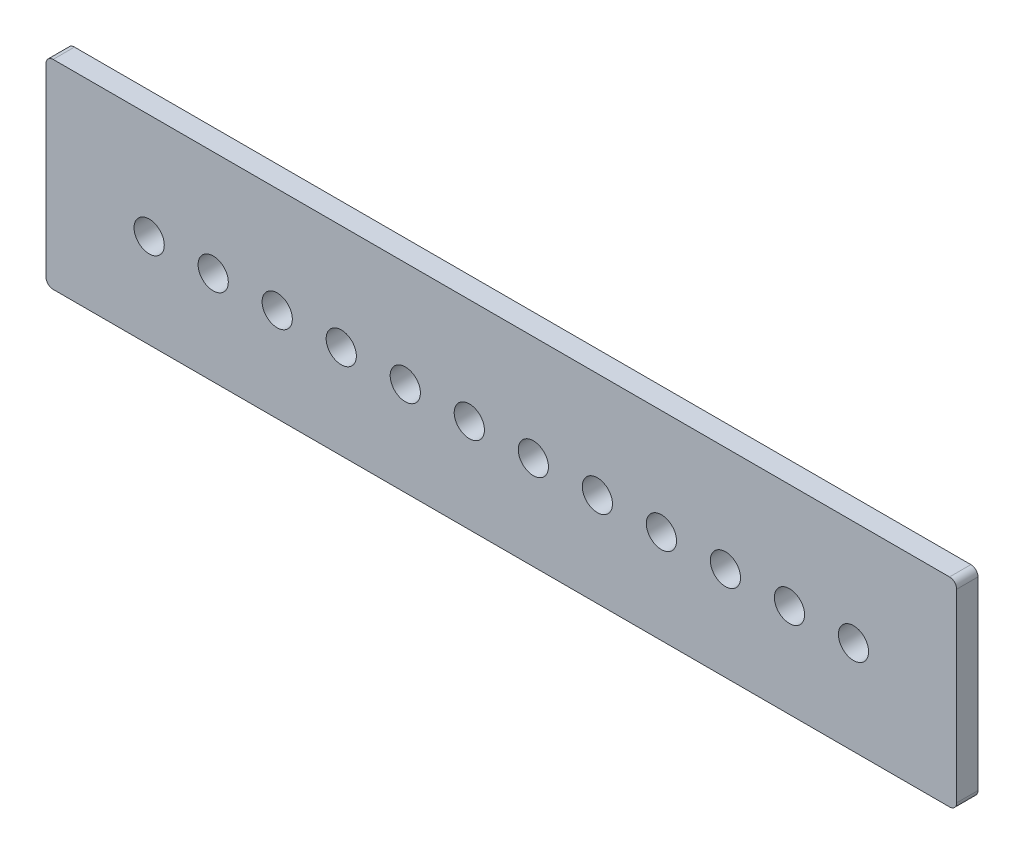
ISO-10303-21;
HEADER;
FILE_DESCRIPTION(('STEP AP214'),'2;1');
FILE_NAME('part.step','',(''),(''),'','','');
FILE_SCHEMA(('AUTOMOTIVE_DESIGN { 1 0 10303 214 1 1 1 1 }'));
ENDSEC;
DATA;
#1=APPLICATION_CONTEXT('core data for automotive mechanical design processes');
#2=APPLICATION_PROTOCOL_DEFINITION('international standard','automotive_design',2000,#1);
#3=PRODUCT_CONTEXT('',#1,'mechanical');
#4=PRODUCT('Part','Part','',(#3));
#5=PRODUCT_RELATED_PRODUCT_CATEGORY('part','',(#4));
#6=PRODUCT_DEFINITION_FORMATION('','',#4);
#7=PRODUCT_DEFINITION_CONTEXT('part definition',#1,'design');
#8=PRODUCT_DEFINITION('design','',#6,#7);
#9=PRODUCT_DEFINITION_SHAPE('','',#8);
#10=(LENGTH_UNIT() NAMED_UNIT(*) SI_UNIT(.MILLI.,.METRE.));
#11=(NAMED_UNIT(*) PLANE_ANGLE_UNIT() SI_UNIT($,.RADIAN.));
#12=(NAMED_UNIT(*) SI_UNIT($,.STERADIAN.) SOLID_ANGLE_UNIT());
#13=UNCERTAINTY_MEASURE_WITH_UNIT(LENGTH_MEASURE(1.E-05),#10,'distance_accuracy_value','');
#14=(GEOMETRIC_REPRESENTATION_CONTEXT(3) GLOBAL_UNCERTAINTY_ASSIGNED_CONTEXT((#13)) GLOBAL_UNIT_ASSIGNED_CONTEXT((#10,
#11,#12)) REPRESENTATION_CONTEXT('',''));
#15=CARTESIAN_POINT('',(0.,0.,0.));
#16=DIRECTION('',(0.,0.,1.));
#17=DIRECTION('',(1.,0.,0.));
#18=AXIS2_PLACEMENT_3D('',#15,#16,#17);
#19=CARTESIAN_POINT('',(0.,0.,9.525));
#20=DIRECTION('',(1.,0.,0.));
#21=DIRECTION('',(0.,0.,-1.));
#22=AXIS2_PLACEMENT_3D('',#19,#20,#21);
#23=PLANE('',#22);
#24=DIRECTION('',(0.,-1.,0.));
#25=VECTOR('',#24,1.);
#26=CARTESIAN_POINT('',(0.,0.,0.));
#27=LINE('',#26,#25);
#28=CARTESIAN_POINT('',(0.,85.725,0.));
#29=VERTEX_POINT('',#28);
#30=CARTESIAN_POINT('',(0.,3.175,0.));
#31=VERTEX_POINT('',#30);
#32=EDGE_CURVE('E128',#29,#31,#27,.T.);
#33=ORIENTED_EDGE('',*,*,#32,.T.);
#34=DIRECTION('',(0.,0.,-1.));
#35=VECTOR('',#34,1.);
#36=CARTESIAN_POINT('',(0.,3.175,9.525));
#37=LINE('',#36,#35);
#38=CARTESIAN_POINT('',(0.,3.175,9.525));
#39=VERTEX_POINT('',#38);
#40=EDGE_CURVE('E105',#31,#39,#37,.F.);
#41=ORIENTED_EDGE('',*,*,#40,.T.);
#42=DIRECTION('',(0.,-1.,0.));
#43=VECTOR('',#42,1.);
#44=CARTESIAN_POINT('',(0.,0.,9.525));
#45=LINE('',#44,#43);
#46=CARTESIAN_POINT('',(0.,85.725,9.525));
#47=VERTEX_POINT('',#46);
#48=EDGE_CURVE('E138',#47,#39,#45,.T.);
#49=ORIENTED_EDGE('',*,*,#48,.F.);
#50=DIRECTION('',(0.,0.,-1.));
#51=VECTOR('',#50,1.);
#52=CARTESIAN_POINT('',(0.,85.725,9.525));
#53=LINE('',#52,#51);
#54=EDGE_CURVE('E110',#47,#29,#53,.T.);
#55=ORIENTED_EDGE('',*,*,#54,.T.);
#56=EDGE_LOOP('',(#33,#41,#49,#55));
#57=FACE_BOUND('',#56,.T.);
#58=ADVANCED_FACE('F34',(#57),#23,.F.);
#59=CARTESIAN_POINT('',(0.,0.,9.525));
#60=DIRECTION('',(0.,1.,0.));
#61=DIRECTION('',(0.,0.,1.));
#62=AXIS2_PLACEMENT_3D('',#59,#60,#61);
#63=PLANE('',#62);
#64=DIRECTION('',(1.,0.,0.));
#65=VECTOR('',#64,1.);
#66=CARTESIAN_POINT('',(0.,0.,9.525));
#67=LINE('',#66,#65);
#68=CARTESIAN_POINT('',(3.175,0.,9.525));
#69=VERTEX_POINT('',#68);
#70=CARTESIAN_POINT('',(403.225,0.,9.525));
#71=VERTEX_POINT('',#70);
#72=EDGE_CURVE('E120',#69,#71,#67,.T.);
#73=ORIENTED_EDGE('',*,*,#72,.F.);
#74=DIRECTION('',(0.,0.,-1.));
#75=VECTOR('',#74,1.);
#76=CARTESIAN_POINT('',(3.175,0.,9.525));
#77=LINE('',#76,#75);
#78=CARTESIAN_POINT('',(3.175,0.,0.));
#79=VERTEX_POINT('',#78);
#80=EDGE_CURVE('E104',#69,#79,#77,.T.);
#81=ORIENTED_EDGE('',*,*,#80,.T.);
#82=DIRECTION('',(1.,0.,0.));
#83=VECTOR('',#82,1.);
#84=CARTESIAN_POINT('',(0.,0.,0.));
#85=LINE('',#84,#83);
#86=CARTESIAN_POINT('',(403.225,0.,0.));
#87=VERTEX_POINT('',#86);
#88=EDGE_CURVE('E117',#79,#87,#85,.T.);
#89=ORIENTED_EDGE('',*,*,#88,.T.);
#90=DIRECTION('',(0.,0.,-1.));
#91=VECTOR('',#90,1.);
#92=CARTESIAN_POINT('',(403.225,0.,9.525));
#93=LINE('',#92,#91);
#94=EDGE_CURVE('E122',#87,#71,#93,.F.);
#95=ORIENTED_EDGE('',*,*,#94,.T.);
#96=EDGE_LOOP('',(#73,#81,#89,#95));
#97=FACE_BOUND('',#96,.T.);
#98=ADVANCED_FACE('F116',(#97),#63,.F.);
#99=CARTESIAN_POINT('',(406.4,0.,9.525));
#100=DIRECTION('',(-1.,0.,0.));
#101=DIRECTION('',(0.,0.,1.));
#102=AXIS2_PLACEMENT_3D('',#99,#100,#101);
#103=PLANE('',#102);
#104=DIRECTION('',(0.,1.,0.));
#105=VECTOR('',#104,1.);
#106=CARTESIAN_POINT('',(406.4,0.,9.525));
#107=LINE('',#106,#105);
#108=CARTESIAN_POINT('',(406.4,3.175,9.525));
#109=VERTEX_POINT('',#108);
#110=CARTESIAN_POINT('',(406.4,85.725,9.525));
#111=VERTEX_POINT('',#110);
#112=EDGE_CURVE('E224',#109,#111,#107,.T.);
#113=ORIENTED_EDGE('',*,*,#112,.F.);
#114=DIRECTION('',(0.,0.,-1.));
#115=VECTOR('',#114,1.);
#116=CARTESIAN_POINT('',(406.4,3.175,9.525));
#117=LINE('',#116,#115);
#118=CARTESIAN_POINT('',(406.4,3.175,0.));
#119=VERTEX_POINT('',#118);
#120=EDGE_CURVE('E217',#109,#119,#117,.T.);
#121=ORIENTED_EDGE('',*,*,#120,.T.);
#122=DIRECTION('',(0.,1.,0.));
#123=VECTOR('',#122,1.);
#124=CARTESIAN_POINT('',(406.4,0.,0.));
#125=LINE('',#124,#123);
#126=CARTESIAN_POINT('',(406.4,85.725,0.));
#127=VERTEX_POINT('',#126);
#128=EDGE_CURVE('E127',#119,#127,#125,.T.);
#129=ORIENTED_EDGE('',*,*,#128,.T.);
#130=DIRECTION('',(0.,0.,-1.));
#131=VECTOR('',#130,1.);
#132=CARTESIAN_POINT('',(406.4,85.725,9.525));
#133=LINE('',#132,#131);
#134=EDGE_CURVE('E215',#127,#111,#133,.F.);
#135=ORIENTED_EDGE('',*,*,#134,.T.);
#136=EDGE_LOOP('',(#113,#121,#129,#135));
#137=FACE_BOUND('',#136,.T.);
#138=ADVANCED_FACE('F222',(#137),#103,.F.);
#139=CARTESIAN_POINT('',(0.,88.9,9.525));
#140=DIRECTION('',(0.,-1.,0.));
#141=DIRECTION('',(0.,0.,-1.));
#142=AXIS2_PLACEMENT_3D('',#139,#140,#141);
#143=PLANE('',#142);
#144=DIRECTION('',(-1.,0.,0.));
#145=VECTOR('',#144,1.);
#146=CARTESIAN_POINT('',(0.,88.9,9.525));
#147=LINE('',#146,#145);
#148=CARTESIAN_POINT('',(403.225,88.9,9.525));
#149=VERTEX_POINT('',#148);
#150=CARTESIAN_POINT('',(3.175,88.9,9.525));
#151=VERTEX_POINT('',#150);
#152=EDGE_CURVE('E143',#149,#151,#147,.T.);
#153=ORIENTED_EDGE('',*,*,#152,.F.);
#154=DIRECTION('',(0.,0.,-1.));
#155=VECTOR('',#154,1.);
#156=CARTESIAN_POINT('',(403.225,88.9,9.525));
#157=LINE('',#156,#155);
#158=CARTESIAN_POINT('',(403.225,88.9,0.));
#159=VERTEX_POINT('',#158);
#160=EDGE_CURVE('E11',#149,#159,#157,.T.);
#161=ORIENTED_EDGE('',*,*,#160,.T.);
#162=DIRECTION('',(-1.,0.,0.));
#163=VECTOR('',#162,1.);
#164=CARTESIAN_POINT('',(0.,88.9,0.));
#165=LINE('',#164,#163);
#166=CARTESIAN_POINT('',(3.175,88.9,0.));
#167=VERTEX_POINT('',#166);
#168=EDGE_CURVE('E131',#159,#167,#165,.T.);
#169=ORIENTED_EDGE('',*,*,#168,.T.);
#170=DIRECTION('',(0.,0.,-1.));
#171=VECTOR('',#170,1.);
#172=CARTESIAN_POINT('',(3.175,88.9,9.525));
#173=LINE('',#172,#171);
#174=EDGE_CURVE('E42',#167,#151,#173,.F.);
#175=ORIENTED_EDGE('',*,*,#174,.T.);
#176=EDGE_LOOP('',(#153,#161,#169,#175));
#177=FACE_BOUND('',#176,.T.);
#178=ADVANCED_FACE('F231',(#177),#143,.F.);
#179=CARTESIAN_POINT('',(0.,0.,9.525));
#180=DIRECTION('',(0.,0.,-1.));
#181=DIRECTION('',(-1.,0.,0.));
#182=AXIS2_PLACEMENT_3D('',#179,#180,#181);
#183=PLANE('',#182);
#184=CARTESIAN_POINT('',(74.6125,41.91,9.525));
#185=DIRECTION('',(0.,0.,1.));
#186=DIRECTION('',(1.,0.,0.));
#187=AXIS2_PLACEMENT_3D('',#184,#185,#186);
#188=CIRCLE('',#187,6.7437);
#189=CARTESIAN_POINT('',(81.3562,41.91,9.525));
#190=VERTEX_POINT('',#189);
#191=EDGE_CURVE('E241',#190,#190,#188,.T.);
#192=ORIENTED_EDGE('',*,*,#191,.F.);
#193=EDGE_LOOP('',(#192));
#194=FACE_BOUND('',#193,.T.);
#195=CARTESIAN_POINT('',(46.0375,41.91,9.525));
#196=DIRECTION('',(0.,0.,1.));
#197=DIRECTION('',(1.,0.,0.));
#198=AXIS2_PLACEMENT_3D('',#195,#196,#197);
#199=CIRCLE('',#198,6.7437);
#200=CARTESIAN_POINT('',(52.7812,41.91,9.525));
#201=VERTEX_POINT('',#200);
#202=EDGE_CURVE('E238',#201,#201,#199,.T.);
#203=ORIENTED_EDGE('',*,*,#202,.F.);
#204=EDGE_LOOP('',(#203));
#205=FACE_BOUND('',#204,.T.);
#206=ORIENTED_EDGE('',*,*,#48,.T.);
#207=CARTESIAN_POINT('',(3.175,3.175,9.525));
#208=DIRECTION('',(0.,0.,-1.));
#209=DIRECTION('',(-1.,0.,0.));
#210=AXIS2_PLACEMENT_3D('',#207,#208,#209);
#211=CIRCLE('',#210,3.175);
#212=EDGE_CURVE('E213',#39,#69,#211,.F.);
#213=ORIENTED_EDGE('',*,*,#212,.T.);
#214=ORIENTED_EDGE('',*,*,#72,.T.);
#215=CARTESIAN_POINT('',(403.225,3.175,9.525));
#216=DIRECTION('',(0.,0.,-1.));
#217=DIRECTION('',(-1.,0.,0.));
#218=AXIS2_PLACEMENT_3D('',#215,#216,#217);
#219=CIRCLE('',#218,3.175);
#220=EDGE_CURVE('E211',#71,#109,#219,.F.);
#221=ORIENTED_EDGE('',*,*,#220,.T.);
#222=ORIENTED_EDGE('',*,*,#112,.T.);
#223=CARTESIAN_POINT('',(403.225,85.725,9.525));
#224=DIRECTION('',(0.,0.,-1.));
#225=DIRECTION('',(-1.,0.,0.));
#226=AXIS2_PLACEMENT_3D('',#223,#224,#225);
#227=CIRCLE('',#226,3.175);
#228=EDGE_CURVE('E55',#111,#149,#227,.F.);
#229=ORIENTED_EDGE('',*,*,#228,.T.);
#230=ORIENTED_EDGE('',*,*,#152,.T.);
#231=CARTESIAN_POINT('',(3.175,85.725,9.525));
#232=DIRECTION('',(0.,0.,-1.));
#233=DIRECTION('',(-1.,0.,0.));
#234=AXIS2_PLACEMENT_3D('',#231,#232,#233);
#235=CIRCLE('',#234,3.175);
#236=EDGE_CURVE('E208',#151,#47,#235,.F.);
#237=ORIENTED_EDGE('',*,*,#236,.T.);
#238=EDGE_LOOP('',(#206,#213,#214,#221,#222,#229,#230,#237));
#239=FACE_BOUND('',#238,.T.);
#240=CARTESIAN_POINT('',(103.1875,41.91,9.525));
#241=DIRECTION('',(0.,0.,1.));
#242=DIRECTION('',(1.,0.,0.));
#243=AXIS2_PLACEMENT_3D('',#240,#241,#242);
#244=CIRCLE('',#243,6.7437);
#245=CARTESIAN_POINT('',(109.9312,41.91,9.525));
#246=VERTEX_POINT('',#245);
#247=EDGE_CURVE('E142',#246,#246,#244,.T.);
#248=ORIENTED_EDGE('',*,*,#247,.F.);
#249=EDGE_LOOP('',(#248));
#250=FACE_BOUND('',#249,.T.);
#251=CARTESIAN_POINT('',(131.7625,41.91,9.525));
#252=DIRECTION('',(0.,0.,1.));
#253=DIRECTION('',(1.,0.,0.));
#254=AXIS2_PLACEMENT_3D('',#251,#252,#253);
#255=CIRCLE('',#254,6.7437);
#256=CARTESIAN_POINT('',(138.5062,41.91,9.525));
#257=VERTEX_POINT('',#256);
#258=EDGE_CURVE('E149',#257,#257,#255,.T.);
#259=ORIENTED_EDGE('',*,*,#258,.F.);
#260=EDGE_LOOP('',(#259));
#261=FACE_BOUND('',#260,.T.);
#262=CARTESIAN_POINT('',(160.3375,41.91,9.525));
#263=DIRECTION('',(0.,0.,1.));
#264=DIRECTION('',(1.,0.,0.));
#265=AXIS2_PLACEMENT_3D('',#262,#263,#264);
#266=CIRCLE('',#265,6.7437);
#267=CARTESIAN_POINT('',(167.0812,41.91,9.525));
#268=VERTEX_POINT('',#267);
#269=EDGE_CURVE('E155',#268,#268,#266,.T.);
#270=ORIENTED_EDGE('',*,*,#269,.F.);
#271=EDGE_LOOP('',(#270));
#272=FACE_BOUND('',#271,.T.);
#273=CARTESIAN_POINT('',(188.9125,41.91,9.525));
#274=DIRECTION('',(0.,0.,1.));
#275=DIRECTION('',(1.,0.,0.));
#276=AXIS2_PLACEMENT_3D('',#273,#274,#275);
#277=CIRCLE('',#276,6.7437);
#278=CARTESIAN_POINT('',(195.6562,41.91,9.525));
#279=VERTEX_POINT('',#278);
#280=EDGE_CURVE('E161',#279,#279,#277,.T.);
#281=ORIENTED_EDGE('',*,*,#280,.F.);
#282=EDGE_LOOP('',(#281));
#283=FACE_BOUND('',#282,.T.);
#284=CARTESIAN_POINT('',(217.4875,41.91,9.525));
#285=DIRECTION('',(0.,0.,1.));
#286=DIRECTION('',(1.,0.,0.));
#287=AXIS2_PLACEMENT_3D('',#284,#285,#286);
#288=CIRCLE('',#287,6.7437);
#289=CARTESIAN_POINT('',(224.2312,41.91,9.525));
#290=VERTEX_POINT('',#289);
#291=EDGE_CURVE('E167',#290,#290,#288,.T.);
#292=ORIENTED_EDGE('',*,*,#291,.F.);
#293=EDGE_LOOP('',(#292));
#294=FACE_BOUND('',#293,.T.);
#295=CARTESIAN_POINT('',(246.0625,41.91,9.525));
#296=DIRECTION('',(0.,0.,1.));
#297=DIRECTION('',(1.,0.,0.));
#298=AXIS2_PLACEMENT_3D('',#295,#296,#297);
#299=CIRCLE('',#298,6.7437);
#300=CARTESIAN_POINT('',(252.8062,41.91,9.525));
#301=VERTEX_POINT('',#300);
#302=EDGE_CURVE('E173',#301,#301,#299,.T.);
#303=ORIENTED_EDGE('',*,*,#302,.F.);
#304=EDGE_LOOP('',(#303));
#305=FACE_BOUND('',#304,.T.);
#306=CARTESIAN_POINT('',(274.6375,41.91,9.525));
#307=DIRECTION('',(0.,0.,1.));
#308=DIRECTION('',(1.,0.,0.));
#309=AXIS2_PLACEMENT_3D('',#306,#307,#308);
#310=CIRCLE('',#309,6.7437);
#311=CARTESIAN_POINT('',(281.3812,41.91,9.525));
#312=VERTEX_POINT('',#311);
#313=EDGE_CURVE('E179',#312,#312,#310,.T.);
#314=ORIENTED_EDGE('',*,*,#313,.F.);
#315=EDGE_LOOP('',(#314));
#316=FACE_BOUND('',#315,.T.);
#317=CARTESIAN_POINT('',(303.2125,41.91,9.525));
#318=DIRECTION('',(0.,0.,1.));
#319=DIRECTION('',(1.,0.,0.));
#320=AXIS2_PLACEMENT_3D('',#317,#318,#319);
#321=CIRCLE('',#320,6.7437);
#322=CARTESIAN_POINT('',(309.9562,41.91,9.525));
#323=VERTEX_POINT('',#322);
#324=EDGE_CURVE('E185',#323,#323,#321,.T.);
#325=ORIENTED_EDGE('',*,*,#324,.F.);
#326=EDGE_LOOP('',(#325));
#327=FACE_BOUND('',#326,.T.);
#328=CARTESIAN_POINT('',(331.7875,41.91,9.525));
#329=DIRECTION('',(0.,0.,1.));
#330=DIRECTION('',(1.,0.,0.));
#331=AXIS2_PLACEMENT_3D('',#328,#329,#330);
#332=CIRCLE('',#331,6.7437);
#333=CARTESIAN_POINT('',(338.5312,41.91,9.525));
#334=VERTEX_POINT('',#333);
#335=EDGE_CURVE('E191',#334,#334,#332,.T.);
#336=ORIENTED_EDGE('',*,*,#335,.F.);
#337=EDGE_LOOP('',(#336));
#338=FACE_BOUND('',#337,.T.);
#339=CARTESIAN_POINT('',(360.3625,41.91,9.525));
#340=DIRECTION('',(0.,0.,1.));
#341=DIRECTION('',(1.,0.,0.));
#342=AXIS2_PLACEMENT_3D('',#339,#340,#341);
#343=CIRCLE('',#342,6.7437);
#344=CARTESIAN_POINT('',(367.1062,41.91,9.525));
#345=VERTEX_POINT('',#344);
#346=EDGE_CURVE('E197',#345,#345,#343,.T.);
#347=ORIENTED_EDGE('',*,*,#346,.F.);
#348=EDGE_LOOP('',(#347));
#349=FACE_BOUND('',#348,.T.);
#350=ADVANCED_FACE('F260',(#194,#205,#239,#250,#261,#272,#283,#294,#305,#316,#327,#338,#349),
#183,.F.);
#351=CARTESIAN_POINT('',(0.,0.,0.));
#352=DIRECTION('',(0.,0.,-1.));
#353=DIRECTION('',(-1.,0.,0.));
#354=AXIS2_PLACEMENT_3D('',#351,#352,#353);
#355=PLANE('',#354);
#356=CARTESIAN_POINT('',(74.6125,41.91,0.));
#357=DIRECTION('',(0.,0.,1.));
#358=DIRECTION('',(1.,0.,0.));
#359=AXIS2_PLACEMENT_3D('',#356,#357,#358);
#360=CIRCLE('',#359,6.7437);
#361=CARTESIAN_POINT('',(81.3562,41.91,0.));
#362=VERTEX_POINT('',#361);
#363=EDGE_CURVE('E246',#362,#362,#360,.T.);
#364=ORIENTED_EDGE('',*,*,#363,.T.);
#365=EDGE_LOOP('',(#364));
#366=FACE_BOUND('',#365,.T.);
#367=CARTESIAN_POINT('',(46.0375,41.91,0.));
#368=DIRECTION('',(0.,0.,1.));
#369=DIRECTION('',(1.,0.,0.));
#370=AXIS2_PLACEMENT_3D('',#367,#368,#369);
#371=CIRCLE('',#370,6.7437);
#372=CARTESIAN_POINT('',(52.7812,41.91,0.));
#373=VERTEX_POINT('',#372);
#374=EDGE_CURVE('E133',#373,#373,#371,.T.);
#375=ORIENTED_EDGE('',*,*,#374,.T.);
#376=EDGE_LOOP('',(#375));
#377=FACE_BOUND('',#376,.T.);
#378=ORIENTED_EDGE('',*,*,#88,.F.);
#379=CARTESIAN_POINT('',(3.175,3.175,0.));
#380=DIRECTION('',(0.,0.,-1.));
#381=DIRECTION('',(-1.,0.,0.));
#382=AXIS2_PLACEMENT_3D('',#379,#380,#381);
#383=CIRCLE('',#382,3.175);
#384=EDGE_CURVE('E100',#79,#31,#383,.T.);
#385=ORIENTED_EDGE('',*,*,#384,.T.);
#386=ORIENTED_EDGE('',*,*,#32,.F.);
#387=CARTESIAN_POINT('',(3.175,85.725,0.));
#388=DIRECTION('',(0.,0.,-1.));
#389=DIRECTION('',(-1.,0.,0.));
#390=AXIS2_PLACEMENT_3D('',#387,#388,#389);
#391=CIRCLE('',#390,3.175);
#392=EDGE_CURVE('E121',#29,#167,#391,.T.);
#393=ORIENTED_EDGE('',*,*,#392,.T.);
#394=ORIENTED_EDGE('',*,*,#168,.F.);
#395=CARTESIAN_POINT('',(403.225,85.725,0.));
#396=DIRECTION('',(0.,0.,-1.));
#397=DIRECTION('',(-1.,0.,0.));
#398=AXIS2_PLACEMENT_3D('',#395,#396,#397);
#399=CIRCLE('',#398,3.175);
#400=EDGE_CURVE('E202',#159,#127,#399,.T.);
#401=ORIENTED_EDGE('',*,*,#400,.T.);
#402=ORIENTED_EDGE('',*,*,#128,.F.);
#403=CARTESIAN_POINT('',(403.225,3.175,0.));
#404=DIRECTION('',(0.,0.,-1.));
#405=DIRECTION('',(-1.,0.,0.));
#406=AXIS2_PLACEMENT_3D('',#403,#404,#405);
#407=CIRCLE('',#406,3.175);
#408=EDGE_CURVE('E111',#119,#87,#407,.T.);
#409=ORIENTED_EDGE('',*,*,#408,.T.);
#410=EDGE_LOOP('',(#378,#385,#386,#393,#394,#401,#402,#409));
#411=FACE_BOUND('',#410,.T.);
#412=CARTESIAN_POINT('',(103.1875,41.91,0.));
#413=DIRECTION('',(0.,0.,1.));
#414=DIRECTION('',(1.,0.,0.));
#415=AXIS2_PLACEMENT_3D('',#412,#413,#414);
#416=CIRCLE('',#415,6.7437);
#417=CARTESIAN_POINT('',(109.9312,41.91,0.));
#418=VERTEX_POINT('',#417);
#419=EDGE_CURVE('E139',#418,#418,#416,.T.);
#420=ORIENTED_EDGE('',*,*,#419,.T.);
#421=EDGE_LOOP('',(#420));
#422=FACE_BOUND('',#421,.T.);
#423=CARTESIAN_POINT('',(131.7625,41.91,0.));
#424=DIRECTION('',(0.,0.,1.));
#425=DIRECTION('',(1.,0.,0.));
#426=AXIS2_PLACEMENT_3D('',#423,#424,#425);
#427=CIRCLE('',#426,6.7437);
#428=CARTESIAN_POINT('',(138.5062,41.91,0.));
#429=VERTEX_POINT('',#428);
#430=EDGE_CURVE('E146',#429,#429,#427,.T.);
#431=ORIENTED_EDGE('',*,*,#430,.T.);
#432=EDGE_LOOP('',(#431));
#433=FACE_BOUND('',#432,.T.);
#434=CARTESIAN_POINT('',(160.3375,41.91,0.));
#435=DIRECTION('',(0.,0.,1.));
#436=DIRECTION('',(1.,0.,0.));
#437=AXIS2_PLACEMENT_3D('',#434,#435,#436);
#438=CIRCLE('',#437,6.7437);
#439=CARTESIAN_POINT('',(167.0812,41.91,0.));
#440=VERTEX_POINT('',#439);
#441=EDGE_CURVE('E152',#440,#440,#438,.T.);
#442=ORIENTED_EDGE('',*,*,#441,.T.);
#443=EDGE_LOOP('',(#442));
#444=FACE_BOUND('',#443,.T.);
#445=CARTESIAN_POINT('',(188.9125,41.91,0.));
#446=DIRECTION('',(0.,0.,1.));
#447=DIRECTION('',(1.,0.,0.));
#448=AXIS2_PLACEMENT_3D('',#445,#446,#447);
#449=CIRCLE('',#448,6.7437);
#450=CARTESIAN_POINT('',(195.6562,41.91,0.));
#451=VERTEX_POINT('',#450);
#452=EDGE_CURVE('E158',#451,#451,#449,.T.);
#453=ORIENTED_EDGE('',*,*,#452,.T.);
#454=EDGE_LOOP('',(#453));
#455=FACE_BOUND('',#454,.T.);
#456=CARTESIAN_POINT('',(217.4875,41.91,0.));
#457=DIRECTION('',(0.,0.,1.));
#458=DIRECTION('',(1.,0.,0.));
#459=AXIS2_PLACEMENT_3D('',#456,#457,#458);
#460=CIRCLE('',#459,6.7437);
#461=CARTESIAN_POINT('',(224.2312,41.91,0.));
#462=VERTEX_POINT('',#461);
#463=EDGE_CURVE('E164',#462,#462,#460,.T.);
#464=ORIENTED_EDGE('',*,*,#463,.T.);
#465=EDGE_LOOP('',(#464));
#466=FACE_BOUND('',#465,.T.);
#467=CARTESIAN_POINT('',(246.0625,41.91,0.));
#468=DIRECTION('',(0.,0.,1.));
#469=DIRECTION('',(1.,0.,0.));
#470=AXIS2_PLACEMENT_3D('',#467,#468,#469);
#471=CIRCLE('',#470,6.7437);
#472=CARTESIAN_POINT('',(252.8062,41.91,0.));
#473=VERTEX_POINT('',#472);
#474=EDGE_CURVE('E170',#473,#473,#471,.T.);
#475=ORIENTED_EDGE('',*,*,#474,.T.);
#476=EDGE_LOOP('',(#475));
#477=FACE_BOUND('',#476,.T.);
#478=CARTESIAN_POINT('',(274.6375,41.91,0.));
#479=DIRECTION('',(0.,0.,1.));
#480=DIRECTION('',(1.,0.,0.));
#481=AXIS2_PLACEMENT_3D('',#478,#479,#480);
#482=CIRCLE('',#481,6.7437);
#483=CARTESIAN_POINT('',(281.3812,41.91,0.));
#484=VERTEX_POINT('',#483);
#485=EDGE_CURVE('E176',#484,#484,#482,.T.);
#486=ORIENTED_EDGE('',*,*,#485,.T.);
#487=EDGE_LOOP('',(#486));
#488=FACE_BOUND('',#487,.T.);
#489=CARTESIAN_POINT('',(303.2125,41.91,0.));
#490=DIRECTION('',(0.,0.,1.));
#491=DIRECTION('',(1.,0.,0.));
#492=AXIS2_PLACEMENT_3D('',#489,#490,#491);
#493=CIRCLE('',#492,6.7437);
#494=CARTESIAN_POINT('',(309.9562,41.91,0.));
#495=VERTEX_POINT('',#494);
#496=EDGE_CURVE('E182',#495,#495,#493,.T.);
#497=ORIENTED_EDGE('',*,*,#496,.T.);
#498=EDGE_LOOP('',(#497));
#499=FACE_BOUND('',#498,.T.);
#500=CARTESIAN_POINT('',(331.7875,41.91,0.));
#501=DIRECTION('',(0.,0.,1.));
#502=DIRECTION('',(1.,0.,0.));
#503=AXIS2_PLACEMENT_3D('',#500,#501,#502);
#504=CIRCLE('',#503,6.7437);
#505=CARTESIAN_POINT('',(338.5312,41.91,0.));
#506=VERTEX_POINT('',#505);
#507=EDGE_CURVE('E188',#506,#506,#504,.T.);
#508=ORIENTED_EDGE('',*,*,#507,.T.);
#509=EDGE_LOOP('',(#508));
#510=FACE_BOUND('',#509,.T.);
#511=CARTESIAN_POINT('',(360.3625,41.91,0.));
#512=DIRECTION('',(0.,0.,1.));
#513=DIRECTION('',(1.,0.,0.));
#514=AXIS2_PLACEMENT_3D('',#511,#512,#513);
#515=CIRCLE('',#514,6.7437);
#516=CARTESIAN_POINT('',(367.1062,41.91,0.));
#517=VERTEX_POINT('',#516);
#518=EDGE_CURVE('E194',#517,#517,#515,.T.);
#519=ORIENTED_EDGE('',*,*,#518,.T.);
#520=EDGE_LOOP('',(#519));
#521=FACE_BOUND('',#520,.T.);
#522=ADVANCED_FACE('F124',(#366,#377,#411,#422,#433,#444,#455,#466,#477,#488,#499,#510,#521),
#355,.T.);
#523=CARTESIAN_POINT('',(46.0375,41.91,0.));
#524=DIRECTION('',(0.,0.,1.));
#525=DIRECTION('',(1.,0.,0.));
#526=AXIS2_PLACEMENT_3D('',#523,#524,#525);
#527=CYLINDRICAL_SURFACE('',#526,6.7437);
#528=CARTESIAN_POINT('',(52.7812,41.91,0.));
#529=CARTESIAN_POINT('',(52.7812,41.91,0.0992187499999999));
#530=CARTESIAN_POINT('',(52.7812,41.91,0.1984375));
#531=CARTESIAN_POINT('',(52.7812,41.91,0.396875));
#532=CARTESIAN_POINT('',(52.7812,41.91,0.49609375));
#533=CARTESIAN_POINT('',(52.7812,41.91,0.69453125));
#534=CARTESIAN_POINT('',(52.7812,41.91,0.79375));
#535=CARTESIAN_POINT('',(52.7812,41.91,0.9921875));
#536=CARTESIAN_POINT('',(52.7812,41.91,1.09140625));
#537=CARTESIAN_POINT('',(52.7812,41.91,1.28984375));
#538=CARTESIAN_POINT('',(52.7812,41.91,1.3890625));
#539=CARTESIAN_POINT('',(52.7812,41.91,1.5875));
#540=CARTESIAN_POINT('',(52.7812,41.91,1.68671875));
#541=CARTESIAN_POINT('',(52.7812,41.91,1.88515625));
#542=CARTESIAN_POINT('',(52.7812,41.91,1.984375));
#543=CARTESIAN_POINT('',(52.7812,41.91,2.1828125));
#544=CARTESIAN_POINT('',(52.7812,41.91,2.28203125));
#545=CARTESIAN_POINT('',(52.7812,41.91,2.48046875));
#546=CARTESIAN_POINT('',(52.7812,41.91,2.5796875));
#547=CARTESIAN_POINT('',(52.7812,41.91,2.778125));
#548=CARTESIAN_POINT('',(52.7812,41.91,2.87734375));
#549=CARTESIAN_POINT('',(52.7812,41.91,3.07578125));
#550=CARTESIAN_POINT('',(52.7812,41.91,3.175));
#551=CARTESIAN_POINT('',(52.7812,41.91,3.3734375));
#552=CARTESIAN_POINT('',(52.7812,41.91,3.47265625));
#553=CARTESIAN_POINT('',(52.7812,41.91,3.67109375));
#554=CARTESIAN_POINT('',(52.7812,41.91,3.7703125));
#555=CARTESIAN_POINT('',(52.7812,41.91,3.96875));
#556=CARTESIAN_POINT('',(52.7812,41.91,4.06796875));
#557=CARTESIAN_POINT('',(52.7812,41.91,4.26640625));
#558=CARTESIAN_POINT('',(52.7812,41.91,4.365625));
#559=CARTESIAN_POINT('',(52.7812,41.91,4.5640625));
#560=CARTESIAN_POINT('',(52.7812,41.91,4.66328125));
#561=CARTESIAN_POINT('',(52.7812,41.91,4.86171875));
#562=CARTESIAN_POINT('',(52.7812,41.91,4.9609375));
#563=CARTESIAN_POINT('',(52.7812,41.91,5.159375));
#564=CARTESIAN_POINT('',(52.7812,41.91,5.25859375));
#565=CARTESIAN_POINT('',(52.7812,41.91,5.45703125));
#566=CARTESIAN_POINT('',(52.7812,41.91,5.55625));
#567=CARTESIAN_POINT('',(52.7812,41.91,5.7546875));
#568=CARTESIAN_POINT('',(52.7812,41.91,5.85390625));
#569=CARTESIAN_POINT('',(52.7812,41.91,6.05234375));
#570=CARTESIAN_POINT('',(52.7812,41.91,6.1515625));
#571=CARTESIAN_POINT('',(52.7812,41.91,6.35));
#572=CARTESIAN_POINT('',(52.7812,41.91,6.44921875));
#573=CARTESIAN_POINT('',(52.7812,41.91,6.64765625));
#574=CARTESIAN_POINT('',(52.7812,41.91,6.746875));
#575=CARTESIAN_POINT('',(52.7812,41.91,6.9453125));
#576=CARTESIAN_POINT('',(52.7812,41.91,7.04453125));
#577=CARTESIAN_POINT('',(52.7812,41.91,7.24296875));
#578=CARTESIAN_POINT('',(52.7812,41.91,7.3421875));
#579=CARTESIAN_POINT('',(52.7812,41.91,7.540625));
#580=CARTESIAN_POINT('',(52.7812,41.91,7.63984375));
#581=CARTESIAN_POINT('',(52.7812,41.91,7.83828125));
#582=CARTESIAN_POINT('',(52.7812,41.91,7.9375));
#583=CARTESIAN_POINT('',(52.7812,41.91,8.1359375));
#584=CARTESIAN_POINT('',(52.7812,41.91,8.23515625));
#585=CARTESIAN_POINT('',(52.7812,41.91,8.43359375));
#586=CARTESIAN_POINT('',(52.7812,41.91,8.5328125));
#587=CARTESIAN_POINT('',(52.7812,41.91,8.73125));
#588=CARTESIAN_POINT('',(52.7812,41.91,8.83046875));
#589=CARTESIAN_POINT('',(52.7812,41.91,9.02890625));
#590=CARTESIAN_POINT('',(52.7812,41.91,9.128125));
#591=CARTESIAN_POINT('',(52.7812,41.91,9.3265625));
#592=CARTESIAN_POINT('',(52.7812,41.91,9.42578125));
#593=CARTESIAN_POINT('',(52.7812,41.91,9.525));
#594=B_SPLINE_CURVE_WITH_KNOTS('',3,(#528,#529,#530,#531,#532,#533,#534,#535,#536,#537,#538,
#539,#540,#541,#542,#543,#544,#545,#546,#547,#548,#549,#550,#551,#552,#553,#554,#555,#556,#557,
#558,#559,#560,#561,#562,#563,#564,#565,#566,#567,#568,#569,#570,#571,#572,#573,#574,#575,#576,
#577,#578,#579,#580,#581,#582,#583,#584,#585,#586,#587,#588,#589,#590,#591,#592,#593),
.UNSPECIFIED.,.F.,.F.,(4,2,2,2,2,2,2,2,2,2,2,2,2,2,2,2,2,2,2,2,2,2,2,2,2,2,2,2,2,2,2,2,4),(0.,
0.29765625,0.5953125,0.89296875,1.190625,1.48828125,1.7859375,2.08359375,2.38125,2.67890625,
2.9765625,3.27421875,3.571875,3.86953125,4.1671875,4.46484375,4.7625,5.06015625,5.3578125,
5.65546875,5.953125,6.25078125,6.5484375,6.84609375,7.14375,7.44140625,7.7390625,8.03671875,
8.334375,8.63203125,8.9296875,9.22734375,9.525),.UNSPECIFIED.);
#595=EDGE_CURVE('BSEAM256',#373,#201,#594,.T.);
#596=ORIENTED_EDGE('',*,*,#374,.F.);
#597=ORIENTED_EDGE('',*,*,#202,.T.);
#598=ORIENTED_EDGE('',*,*,#595,.T.);
#599=ORIENTED_EDGE('',*,*,#595,.F.);
#600=EDGE_LOOP('',(#596,#598,#597,#599));
#601=FACE_BOUND('',#600,.T.);
#602=ADVANCED_FACE('F256',(#601),#527,.F.);
#603=CARTESIAN_POINT('',(74.6125,41.91,0.));
#604=DIRECTION('',(0.,0.,1.));
#605=DIRECTION('',(1.,0.,0.));
#606=AXIS2_PLACEMENT_3D('',#603,#604,#605);
#607=CYLINDRICAL_SURFACE('',#606,6.7437);
#608=CARTESIAN_POINT('',(81.3562,41.91,0.));
#609=CARTESIAN_POINT('',(81.3562,41.91,0.0992187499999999));
#610=CARTESIAN_POINT('',(81.3562,41.91,0.1984375));
#611=CARTESIAN_POINT('',(81.3562,41.91,0.396875));
#612=CARTESIAN_POINT('',(81.3562,41.91,0.49609375));
#613=CARTESIAN_POINT('',(81.3562,41.91,0.69453125));
#614=CARTESIAN_POINT('',(81.3562,41.91,0.79375));
#615=CARTESIAN_POINT('',(81.3562,41.91,0.9921875));
#616=CARTESIAN_POINT('',(81.3562,41.91,1.09140625));
#617=CARTESIAN_POINT('',(81.3562,41.91,1.28984375));
#618=CARTESIAN_POINT('',(81.3562,41.91,1.3890625));
#619=CARTESIAN_POINT('',(81.3562,41.91,1.5875));
#620=CARTESIAN_POINT('',(81.3562,41.91,1.68671875));
#621=CARTESIAN_POINT('',(81.3562,41.91,1.88515625));
#622=CARTESIAN_POINT('',(81.3562,41.91,1.984375));
#623=CARTESIAN_POINT('',(81.3562,41.91,2.1828125));
#624=CARTESIAN_POINT('',(81.3562,41.91,2.28203125));
#625=CARTESIAN_POINT('',(81.3562,41.91,2.48046875));
#626=CARTESIAN_POINT('',(81.3562,41.91,2.5796875));
#627=CARTESIAN_POINT('',(81.3562,41.91,2.778125));
#628=CARTESIAN_POINT('',(81.3562,41.91,2.87734375));
#629=CARTESIAN_POINT('',(81.3562,41.91,3.07578125));
#630=CARTESIAN_POINT('',(81.3562,41.91,3.175));
#631=CARTESIAN_POINT('',(81.3562,41.91,3.3734375));
#632=CARTESIAN_POINT('',(81.3562,41.91,3.47265625));
#633=CARTESIAN_POINT('',(81.3562,41.91,3.67109375));
#634=CARTESIAN_POINT('',(81.3562,41.91,3.7703125));
#635=CARTESIAN_POINT('',(81.3562,41.91,3.96875));
#636=CARTESIAN_POINT('',(81.3562,41.91,4.06796875));
#637=CARTESIAN_POINT('',(81.3562,41.91,4.26640625));
#638=CARTESIAN_POINT('',(81.3562,41.91,4.365625));
#639=CARTESIAN_POINT('',(81.3562,41.91,4.5640625));
#640=CARTESIAN_POINT('',(81.3562,41.91,4.66328125));
#641=CARTESIAN_POINT('',(81.3562,41.91,4.86171875));
#642=CARTESIAN_POINT('',(81.3562,41.91,4.9609375));
#643=CARTESIAN_POINT('',(81.3562,41.91,5.159375));
#644=CARTESIAN_POINT('',(81.3562,41.91,5.25859375));
#645=CARTESIAN_POINT('',(81.3562,41.91,5.45703125));
#646=CARTESIAN_POINT('',(81.3562,41.91,5.55625));
#647=CARTESIAN_POINT('',(81.3562,41.91,5.7546875));
#648=CARTESIAN_POINT('',(81.3562,41.91,5.85390625));
#649=CARTESIAN_POINT('',(81.3562,41.91,6.05234375));
#650=CARTESIAN_POINT('',(81.3562,41.91,6.1515625));
#651=CARTESIAN_POINT('',(81.3562,41.91,6.35));
#652=CARTESIAN_POINT('',(81.3562,41.91,6.44921875));
#653=CARTESIAN_POINT('',(81.3562,41.91,6.64765625));
#654=CARTESIAN_POINT('',(81.3562,41.91,6.746875));
#655=CARTESIAN_POINT('',(81.3562,41.91,6.9453125));
#656=CARTESIAN_POINT('',(81.3562,41.91,7.04453125));
#657=CARTESIAN_POINT('',(81.3562,41.91,7.24296875));
#658=CARTESIAN_POINT('',(81.3562,41.91,7.3421875));
#659=CARTESIAN_POINT('',(81.3562,41.91,7.540625));
#660=CARTESIAN_POINT('',(81.3562,41.91,7.63984375));
#661=CARTESIAN_POINT('',(81.3562,41.91,7.83828125));
#662=CARTESIAN_POINT('',(81.3562,41.91,7.9375));
#663=CARTESIAN_POINT('',(81.3562,41.91,8.1359375));
#664=CARTESIAN_POINT('',(81.3562,41.91,8.23515625));
#665=CARTESIAN_POINT('',(81.3562,41.91,8.43359375));
#666=CARTESIAN_POINT('',(81.3562,41.91,8.5328125));
#667=CARTESIAN_POINT('',(81.3562,41.91,8.73125));
#668=CARTESIAN_POINT('',(81.3562,41.91,8.83046875));
#669=CARTESIAN_POINT('',(81.3562,41.91,9.02890625));
#670=CARTESIAN_POINT('',(81.3562,41.91,9.128125));
#671=CARTESIAN_POINT('',(81.3562,41.91,9.3265625));
#672=CARTESIAN_POINT('',(81.3562,41.91,9.42578125));
#673=CARTESIAN_POINT('',(81.3562,41.91,9.525));
#674=B_SPLINE_CURVE_WITH_KNOTS('',3,(#608,#609,#610,#611,#612,#613,#614,#615,#616,#617,#618,
#619,#620,#621,#622,#623,#624,#625,#626,#627,#628,#629,#630,#631,#632,#633,#634,#635,#636,#637,
#638,#639,#640,#641,#642,#643,#644,#645,#646,#647,#648,#649,#650,#651,#652,#653,#654,#655,#656,
#657,#658,#659,#660,#661,#662,#663,#664,#665,#666,#667,#668,#669,#670,#671,#672,#673),
.UNSPECIFIED.,.F.,.F.,(4,2,2,2,2,2,2,2,2,2,2,2,2,2,2,2,2,2,2,2,2,2,2,2,2,2,2,2,2,2,2,2,4),(0.,
0.29765625,0.5953125,0.89296875,1.190625,1.48828125,1.7859375,2.08359375,2.38125,2.67890625,
2.9765625,3.27421875,3.571875,3.86953125,4.1671875,4.46484375,4.7625,5.06015625,5.3578125,
5.65546875,5.953125,6.25078125,6.5484375,6.84609375,7.14375,7.44140625,7.7390625,8.03671875,
8.334375,8.63203125,8.9296875,9.22734375,9.525),.UNSPECIFIED.);
#675=EDGE_CURVE('BSEAM252',#362,#190,#674,.T.);
#676=ORIENTED_EDGE('',*,*,#363,.F.);
#677=ORIENTED_EDGE('',*,*,#191,.T.);
#678=ORIENTED_EDGE('',*,*,#675,.T.);
#679=ORIENTED_EDGE('',*,*,#675,.F.);
#680=EDGE_LOOP('',(#676,#678,#677,#679));
#681=FACE_BOUND('',#680,.T.);
#682=ADVANCED_FACE('F252',(#681),#607,.F.);
#683=CARTESIAN_POINT('',(103.1875,41.91,0.));
#684=DIRECTION('',(0.,0.,1.));
#685=DIRECTION('',(1.,0.,0.));
#686=AXIS2_PLACEMENT_3D('',#683,#684,#685);
#687=CYLINDRICAL_SURFACE('',#686,6.7437);
#688=CARTESIAN_POINT('',(109.9312,41.91,0.));
#689=CARTESIAN_POINT('',(109.9312,41.91,0.0992187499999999));
#690=CARTESIAN_POINT('',(109.9312,41.91,0.1984375));
#691=CARTESIAN_POINT('',(109.9312,41.91,0.396875));
#692=CARTESIAN_POINT('',(109.9312,41.91,0.49609375));
#693=CARTESIAN_POINT('',(109.9312,41.91,0.69453125));
#694=CARTESIAN_POINT('',(109.9312,41.91,0.79375));
#695=CARTESIAN_POINT('',(109.9312,41.91,0.9921875));
#696=CARTESIAN_POINT('',(109.9312,41.91,1.09140625));
#697=CARTESIAN_POINT('',(109.9312,41.91,1.28984375));
#698=CARTESIAN_POINT('',(109.9312,41.91,1.3890625));
#699=CARTESIAN_POINT('',(109.9312,41.91,1.5875));
#700=CARTESIAN_POINT('',(109.9312,41.91,1.68671875));
#701=CARTESIAN_POINT('',(109.9312,41.91,1.88515625));
#702=CARTESIAN_POINT('',(109.9312,41.91,1.984375));
#703=CARTESIAN_POINT('',(109.9312,41.91,2.1828125));
#704=CARTESIAN_POINT('',(109.9312,41.91,2.28203125));
#705=CARTESIAN_POINT('',(109.9312,41.91,2.48046875));
#706=CARTESIAN_POINT('',(109.9312,41.91,2.5796875));
#707=CARTESIAN_POINT('',(109.9312,41.91,2.778125));
#708=CARTESIAN_POINT('',(109.9312,41.91,2.87734375));
#709=CARTESIAN_POINT('',(109.9312,41.91,3.07578125));
#710=CARTESIAN_POINT('',(109.9312,41.91,3.175));
#711=CARTESIAN_POINT('',(109.9312,41.91,3.3734375));
#712=CARTESIAN_POINT('',(109.9312,41.91,3.47265625));
#713=CARTESIAN_POINT('',(109.9312,41.91,3.67109375));
#714=CARTESIAN_POINT('',(109.9312,41.91,3.7703125));
#715=CARTESIAN_POINT('',(109.9312,41.91,3.96875));
#716=CARTESIAN_POINT('',(109.9312,41.91,4.06796875));
#717=CARTESIAN_POINT('',(109.9312,41.91,4.26640625));
#718=CARTESIAN_POINT('',(109.9312,41.91,4.365625));
#719=CARTESIAN_POINT('',(109.9312,41.91,4.5640625));
#720=CARTESIAN_POINT('',(109.9312,41.91,4.66328125));
#721=CARTESIAN_POINT('',(109.9312,41.91,4.86171875));
#722=CARTESIAN_POINT('',(109.9312,41.91,4.9609375));
#723=CARTESIAN_POINT('',(109.9312,41.91,5.159375));
#724=CARTESIAN_POINT('',(109.9312,41.91,5.25859375));
#725=CARTESIAN_POINT('',(109.9312,41.91,5.45703125));
#726=CARTESIAN_POINT('',(109.9312,41.91,5.55625));
#727=CARTESIAN_POINT('',(109.9312,41.91,5.7546875));
#728=CARTESIAN_POINT('',(109.9312,41.91,5.85390625));
#729=CARTESIAN_POINT('',(109.9312,41.91,6.05234375));
#730=CARTESIAN_POINT('',(109.9312,41.91,6.1515625));
#731=CARTESIAN_POINT('',(109.9312,41.91,6.35));
#732=CARTESIAN_POINT('',(109.9312,41.91,6.44921875));
#733=CARTESIAN_POINT('',(109.9312,41.91,6.64765625));
#734=CARTESIAN_POINT('',(109.9312,41.91,6.746875));
#735=CARTESIAN_POINT('',(109.9312,41.91,6.9453125));
#736=CARTESIAN_POINT('',(109.9312,41.91,7.04453125));
#737=CARTESIAN_POINT('',(109.9312,41.91,7.24296875));
#738=CARTESIAN_POINT('',(109.9312,41.91,7.3421875));
#739=CARTESIAN_POINT('',(109.9312,41.91,7.540625));
#740=CARTESIAN_POINT('',(109.9312,41.91,7.63984375));
#741=CARTESIAN_POINT('',(109.9312,41.91,7.83828125));
#742=CARTESIAN_POINT('',(109.9312,41.91,7.9375));
#743=CARTESIAN_POINT('',(109.9312,41.91,8.1359375));
#744=CARTESIAN_POINT('',(109.9312,41.91,8.23515625));
#745=CARTESIAN_POINT('',(109.9312,41.91,8.43359375));
#746=CARTESIAN_POINT('',(109.9312,41.91,8.5328125));
#747=CARTESIAN_POINT('',(109.9312,41.91,8.73125));
#748=CARTESIAN_POINT('',(109.9312,41.91,8.83046875));
#749=CARTESIAN_POINT('',(109.9312,41.91,9.02890625));
#750=CARTESIAN_POINT('',(109.9312,41.91,9.128125));
#751=CARTESIAN_POINT('',(109.9312,41.91,9.3265625));
#752=CARTESIAN_POINT('',(109.9312,41.91,9.42578125));
#753=CARTESIAN_POINT('',(109.9312,41.91,9.525));
#754=B_SPLINE_CURVE_WITH_KNOTS('',3,(#688,#689,#690,#691,#692,#693,#694,#695,#696,#697,#698,
#699,#700,#701,#702,#703,#704,#705,#706,#707,#708,#709,#710,#711,#712,#713,#714,#715,#716,#717,
#718,#719,#720,#721,#722,#723,#724,#725,#726,#727,#728,#729,#730,#731,#732,#733,#734,#735,#736,
#737,#738,#739,#740,#741,#742,#743,#744,#745,#746,#747,#748,#749,#750,#751,#752,#753),
.UNSPECIFIED.,.F.,.F.,(4,2,2,2,2,2,2,2,2,2,2,2,2,2,2,2,2,2,2,2,2,2,2,2,2,2,2,2,2,2,2,2,4),(0.,
0.29765625,0.5953125,0.89296875,1.190625,1.48828125,1.7859375,2.08359375,2.38125,2.67890625,
2.9765625,3.27421875,3.571875,3.86953125,4.1671875,4.46484375,4.7625,5.06015625,5.3578125,
5.65546875,5.953125,6.25078125,6.5484375,6.84609375,7.14375,7.44140625,7.7390625,8.03671875,
8.334375,8.63203125,8.9296875,9.22734375,9.525),.UNSPECIFIED.);
#755=EDGE_CURVE('BSEAM255',#418,#246,#754,.T.);
#756=ORIENTED_EDGE('',*,*,#419,.F.);
#757=ORIENTED_EDGE('',*,*,#247,.T.);
#758=ORIENTED_EDGE('',*,*,#755,.T.);
#759=ORIENTED_EDGE('',*,*,#755,.F.);
#760=EDGE_LOOP('',(#756,#758,#757,#759));
#761=FACE_BOUND('',#760,.T.);
#762=ADVANCED_FACE('F255',(#761),#687,.F.);
#763=CARTESIAN_POINT('',(131.7625,41.91,0.));
#764=DIRECTION('',(0.,0.,1.));
#765=DIRECTION('',(1.,0.,0.));
#766=AXIS2_PLACEMENT_3D('',#763,#764,#765);
#767=CYLINDRICAL_SURFACE('',#766,6.7437);
#768=CARTESIAN_POINT('',(138.5062,41.91,0.));
#769=CARTESIAN_POINT('',(138.5062,41.91,0.0992187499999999));
#770=CARTESIAN_POINT('',(138.5062,41.91,0.1984375));
#771=CARTESIAN_POINT('',(138.5062,41.91,0.396875));
#772=CARTESIAN_POINT('',(138.5062,41.91,0.49609375));
#773=CARTESIAN_POINT('',(138.5062,41.91,0.69453125));
#774=CARTESIAN_POINT('',(138.5062,41.91,0.79375));
#775=CARTESIAN_POINT('',(138.5062,41.91,0.9921875));
#776=CARTESIAN_POINT('',(138.5062,41.91,1.09140625));
#777=CARTESIAN_POINT('',(138.5062,41.91,1.28984375));
#778=CARTESIAN_POINT('',(138.5062,41.91,1.3890625));
#779=CARTESIAN_POINT('',(138.5062,41.91,1.5875));
#780=CARTESIAN_POINT('',(138.5062,41.91,1.68671875));
#781=CARTESIAN_POINT('',(138.5062,41.91,1.88515625));
#782=CARTESIAN_POINT('',(138.5062,41.91,1.984375));
#783=CARTESIAN_POINT('',(138.5062,41.91,2.1828125));
#784=CARTESIAN_POINT('',(138.5062,41.91,2.28203125));
#785=CARTESIAN_POINT('',(138.5062,41.91,2.48046875));
#786=CARTESIAN_POINT('',(138.5062,41.91,2.5796875));
#787=CARTESIAN_POINT('',(138.5062,41.91,2.778125));
#788=CARTESIAN_POINT('',(138.5062,41.91,2.87734375));
#789=CARTESIAN_POINT('',(138.5062,41.91,3.07578125));
#790=CARTESIAN_POINT('',(138.5062,41.91,3.175));
#791=CARTESIAN_POINT('',(138.5062,41.91,3.3734375));
#792=CARTESIAN_POINT('',(138.5062,41.91,3.47265625));
#793=CARTESIAN_POINT('',(138.5062,41.91,3.67109375));
#794=CARTESIAN_POINT('',(138.5062,41.91,3.7703125));
#795=CARTESIAN_POINT('',(138.5062,41.91,3.96875));
#796=CARTESIAN_POINT('',(138.5062,41.91,4.06796875));
#797=CARTESIAN_POINT('',(138.5062,41.91,4.26640625));
#798=CARTESIAN_POINT('',(138.5062,41.91,4.365625));
#799=CARTESIAN_POINT('',(138.5062,41.91,4.5640625));
#800=CARTESIAN_POINT('',(138.5062,41.91,4.66328125));
#801=CARTESIAN_POINT('',(138.5062,41.91,4.86171875));
#802=CARTESIAN_POINT('',(138.5062,41.91,4.9609375));
#803=CARTESIAN_POINT('',(138.5062,41.91,5.159375));
#804=CARTESIAN_POINT('',(138.5062,41.91,5.25859375));
#805=CARTESIAN_POINT('',(138.5062,41.91,5.45703125));
#806=CARTESIAN_POINT('',(138.5062,41.91,5.55625));
#807=CARTESIAN_POINT('',(138.5062,41.91,5.7546875));
#808=CARTESIAN_POINT('',(138.5062,41.91,5.85390625));
#809=CARTESIAN_POINT('',(138.5062,41.91,6.05234375));
#810=CARTESIAN_POINT('',(138.5062,41.91,6.1515625));
#811=CARTESIAN_POINT('',(138.5062,41.91,6.35));
#812=CARTESIAN_POINT('',(138.5062,41.91,6.44921875));
#813=CARTESIAN_POINT('',(138.5062,41.91,6.64765625));
#814=CARTESIAN_POINT('',(138.5062,41.91,6.746875));
#815=CARTESIAN_POINT('',(138.5062,41.91,6.9453125));
#816=CARTESIAN_POINT('',(138.5062,41.91,7.04453125));
#817=CARTESIAN_POINT('',(138.5062,41.91,7.24296875));
#818=CARTESIAN_POINT('',(138.5062,41.91,7.3421875));
#819=CARTESIAN_POINT('',(138.5062,41.91,7.540625));
#820=CARTESIAN_POINT('',(138.5062,41.91,7.63984375));
#821=CARTESIAN_POINT('',(138.5062,41.91,7.83828125));
#822=CARTESIAN_POINT('',(138.5062,41.91,7.9375));
#823=CARTESIAN_POINT('',(138.5062,41.91,8.1359375));
#824=CARTESIAN_POINT('',(138.5062,41.91,8.23515625));
#825=CARTESIAN_POINT('',(138.5062,41.91,8.43359375));
#826=CARTESIAN_POINT('',(138.5062,41.91,8.5328125));
#827=CARTESIAN_POINT('',(138.5062,41.91,8.73125));
#828=CARTESIAN_POINT('',(138.5062,41.91,8.83046875));
#829=CARTESIAN_POINT('',(138.5062,41.91,9.02890625));
#830=CARTESIAN_POINT('',(138.5062,41.91,9.128125));
#831=CARTESIAN_POINT('',(138.5062,41.91,9.3265625));
#832=CARTESIAN_POINT('',(138.5062,41.91,9.42578125));
#833=CARTESIAN_POINT('',(138.5062,41.91,9.525));
#834=B_SPLINE_CURVE_WITH_KNOTS('',3,(#768,#769,#770,#771,#772,#773,#774,#775,#776,#777,#778,
#779,#780,#781,#782,#783,#784,#785,#786,#787,#788,#789,#790,#791,#792,#793,#794,#795,#796,#797,
#798,#799,#800,#801,#802,#803,#804,#805,#806,#807,#808,#809,#810,#811,#812,#813,#814,#815,#816,
#817,#818,#819,#820,#821,#822,#823,#824,#825,#826,#827,#828,#829,#830,#831,#832,#833),
.UNSPECIFIED.,.F.,.F.,(4,2,2,2,2,2,2,2,2,2,2,2,2,2,2,2,2,2,2,2,2,2,2,2,2,2,2,2,2,2,2,2,4),(0.,
0.29765625,0.5953125,0.89296875,1.190625,1.48828125,1.7859375,2.08359375,2.38125,2.67890625,
2.9765625,3.27421875,3.571875,3.86953125,4.1671875,4.46484375,4.7625,5.06015625,5.3578125,
5.65546875,5.953125,6.25078125,6.5484375,6.84609375,7.14375,7.44140625,7.7390625,8.03671875,
8.334375,8.63203125,8.9296875,9.22734375,9.525),.UNSPECIFIED.);
#835=EDGE_CURVE('BSEAM313',#429,#257,#834,.T.);
#836=ORIENTED_EDGE('',*,*,#430,.F.);
#837=ORIENTED_EDGE('',*,*,#258,.T.);
#838=ORIENTED_EDGE('',*,*,#835,.T.);
#839=ORIENTED_EDGE('',*,*,#835,.F.);
#840=EDGE_LOOP('',(#836,#838,#837,#839));
#841=FACE_BOUND('',#840,.T.);
#842=ADVANCED_FACE('F313',(#841),#767,.F.);
#843=CARTESIAN_POINT('',(160.3375,41.91,0.));
#844=DIRECTION('',(0.,0.,1.));
#845=DIRECTION('',(1.,0.,0.));
#846=AXIS2_PLACEMENT_3D('',#843,#844,#845);
#847=CYLINDRICAL_SURFACE('',#846,6.7437);
#848=CARTESIAN_POINT('',(167.0812,41.91,0.));
#849=CARTESIAN_POINT('',(167.0812,41.91,0.0992187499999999));
#850=CARTESIAN_POINT('',(167.0812,41.91,0.1984375));
#851=CARTESIAN_POINT('',(167.0812,41.91,0.396875));
#852=CARTESIAN_POINT('',(167.0812,41.91,0.49609375));
#853=CARTESIAN_POINT('',(167.0812,41.91,0.69453125));
#854=CARTESIAN_POINT('',(167.0812,41.91,0.79375));
#855=CARTESIAN_POINT('',(167.0812,41.91,0.9921875));
#856=CARTESIAN_POINT('',(167.0812,41.91,1.09140625));
#857=CARTESIAN_POINT('',(167.0812,41.91,1.28984375));
#858=CARTESIAN_POINT('',(167.0812,41.91,1.3890625));
#859=CARTESIAN_POINT('',(167.0812,41.91,1.5875));
#860=CARTESIAN_POINT('',(167.0812,41.91,1.68671875));
#861=CARTESIAN_POINT('',(167.0812,41.91,1.88515625));
#862=CARTESIAN_POINT('',(167.0812,41.91,1.984375));
#863=CARTESIAN_POINT('',(167.0812,41.91,2.1828125));
#864=CARTESIAN_POINT('',(167.0812,41.91,2.28203125));
#865=CARTESIAN_POINT('',(167.0812,41.91,2.48046875));
#866=CARTESIAN_POINT('',(167.0812,41.91,2.5796875));
#867=CARTESIAN_POINT('',(167.0812,41.91,2.778125));
#868=CARTESIAN_POINT('',(167.0812,41.91,2.87734375));
#869=CARTESIAN_POINT('',(167.0812,41.91,3.07578125));
#870=CARTESIAN_POINT('',(167.0812,41.91,3.175));
#871=CARTESIAN_POINT('',(167.0812,41.91,3.3734375));
#872=CARTESIAN_POINT('',(167.0812,41.91,3.47265625));
#873=CARTESIAN_POINT('',(167.0812,41.91,3.67109375));
#874=CARTESIAN_POINT('',(167.0812,41.91,3.7703125));
#875=CARTESIAN_POINT('',(167.0812,41.91,3.96875));
#876=CARTESIAN_POINT('',(167.0812,41.91,4.06796875));
#877=CARTESIAN_POINT('',(167.0812,41.91,4.26640625));
#878=CARTESIAN_POINT('',(167.0812,41.91,4.365625));
#879=CARTESIAN_POINT('',(167.0812,41.91,4.5640625));
#880=CARTESIAN_POINT('',(167.0812,41.91,4.66328125));
#881=CARTESIAN_POINT('',(167.0812,41.91,4.86171875));
#882=CARTESIAN_POINT('',(167.0812,41.91,4.9609375));
#883=CARTESIAN_POINT('',(167.0812,41.91,5.159375));
#884=CARTESIAN_POINT('',(167.0812,41.91,5.25859375));
#885=CARTESIAN_POINT('',(167.0812,41.91,5.45703125));
#886=CARTESIAN_POINT('',(167.0812,41.91,5.55625));
#887=CARTESIAN_POINT('',(167.0812,41.91,5.7546875));
#888=CARTESIAN_POINT('',(167.0812,41.91,5.85390625));
#889=CARTESIAN_POINT('',(167.0812,41.91,6.05234375));
#890=CARTESIAN_POINT('',(167.0812,41.91,6.1515625));
#891=CARTESIAN_POINT('',(167.0812,41.91,6.35));
#892=CARTESIAN_POINT('',(167.0812,41.91,6.44921875));
#893=CARTESIAN_POINT('',(167.0812,41.91,6.64765625));
#894=CARTESIAN_POINT('',(167.0812,41.91,6.746875));
#895=CARTESIAN_POINT('',(167.0812,41.91,6.9453125));
#896=CARTESIAN_POINT('',(167.0812,41.91,7.04453125));
#897=CARTESIAN_POINT('',(167.0812,41.91,7.24296875));
#898=CARTESIAN_POINT('',(167.0812,41.91,7.3421875));
#899=CARTESIAN_POINT('',(167.0812,41.91,7.540625));
#900=CARTESIAN_POINT('',(167.0812,41.91,7.63984375));
#901=CARTESIAN_POINT('',(167.0812,41.91,7.83828125));
#902=CARTESIAN_POINT('',(167.0812,41.91,7.9375));
#903=CARTESIAN_POINT('',(167.0812,41.91,8.1359375));
#904=CARTESIAN_POINT('',(167.0812,41.91,8.23515625));
#905=CARTESIAN_POINT('',(167.0812,41.91,8.43359375));
#906=CARTESIAN_POINT('',(167.0812,41.91,8.5328125));
#907=CARTESIAN_POINT('',(167.0812,41.91,8.73125));
#908=CARTESIAN_POINT('',(167.0812,41.91,8.83046875));
#909=CARTESIAN_POINT('',(167.0812,41.91,9.02890625));
#910=CARTESIAN_POINT('',(167.0812,41.91,9.128125));
#911=CARTESIAN_POINT('',(167.0812,41.91,9.3265625));
#912=CARTESIAN_POINT('',(167.0812,41.91,9.42578125));
#913=CARTESIAN_POINT('',(167.0812,41.91,9.525));
#914=B_SPLINE_CURVE_WITH_KNOTS('',3,(#848,#849,#850,#851,#852,#853,#854,#855,#856,#857,#858,
#859,#860,#861,#862,#863,#864,#865,#866,#867,#868,#869,#870,#871,#872,#873,#874,#875,#876,#877,
#878,#879,#880,#881,#882,#883,#884,#885,#886,#887,#888,#889,#890,#891,#892,#893,#894,#895,#896,
#897,#898,#899,#900,#901,#902,#903,#904,#905,#906,#907,#908,#909,#910,#911,#912,#913),
.UNSPECIFIED.,.F.,.F.,(4,2,2,2,2,2,2,2,2,2,2,2,2,2,2,2,2,2,2,2,2,2,2,2,2,2,2,2,2,2,2,2,4),(0.,
0.29765625,0.5953125,0.89296875,1.190625,1.48828125,1.7859375,2.08359375,2.38125,2.67890625,
2.9765625,3.27421875,3.571875,3.86953125,4.1671875,4.46484375,4.7625,5.06015625,5.3578125,
5.65546875,5.953125,6.25078125,6.5484375,6.84609375,7.14375,7.44140625,7.7390625,8.03671875,
8.334375,8.63203125,8.9296875,9.22734375,9.525),.UNSPECIFIED.);
#915=EDGE_CURVE('BSEAM317',#440,#268,#914,.T.);
#916=ORIENTED_EDGE('',*,*,#441,.F.);
#917=ORIENTED_EDGE('',*,*,#269,.T.);
#918=ORIENTED_EDGE('',*,*,#915,.T.);
#919=ORIENTED_EDGE('',*,*,#915,.F.);
#920=EDGE_LOOP('',(#916,#918,#917,#919));
#921=FACE_BOUND('',#920,.T.);
#922=ADVANCED_FACE('F317',(#921),#847,.F.);
#923=CARTESIAN_POINT('',(188.9125,41.91,0.));
#924=DIRECTION('',(0.,0.,1.));
#925=DIRECTION('',(1.,0.,0.));
#926=AXIS2_PLACEMENT_3D('',#923,#924,#925);
#927=CYLINDRICAL_SURFACE('',#926,6.7437);
#928=CARTESIAN_POINT('',(195.6562,41.91,0.));
#929=CARTESIAN_POINT('',(195.6562,41.91,0.0992187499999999));
#930=CARTESIAN_POINT('',(195.6562,41.91,0.1984375));
#931=CARTESIAN_POINT('',(195.6562,41.91,0.396875));
#932=CARTESIAN_POINT('',(195.6562,41.91,0.49609375));
#933=CARTESIAN_POINT('',(195.6562,41.91,0.69453125));
#934=CARTESIAN_POINT('',(195.6562,41.91,0.79375));
#935=CARTESIAN_POINT('',(195.6562,41.91,0.9921875));
#936=CARTESIAN_POINT('',(195.6562,41.91,1.09140625));
#937=CARTESIAN_POINT('',(195.6562,41.91,1.28984375));
#938=CARTESIAN_POINT('',(195.6562,41.91,1.3890625));
#939=CARTESIAN_POINT('',(195.6562,41.91,1.5875));
#940=CARTESIAN_POINT('',(195.6562,41.91,1.68671875));
#941=CARTESIAN_POINT('',(195.6562,41.91,1.88515625));
#942=CARTESIAN_POINT('',(195.6562,41.91,1.984375));
#943=CARTESIAN_POINT('',(195.6562,41.91,2.1828125));
#944=CARTESIAN_POINT('',(195.6562,41.91,2.28203125));
#945=CARTESIAN_POINT('',(195.6562,41.91,2.48046875));
#946=CARTESIAN_POINT('',(195.6562,41.91,2.5796875));
#947=CARTESIAN_POINT('',(195.6562,41.91,2.778125));
#948=CARTESIAN_POINT('',(195.6562,41.91,2.87734375));
#949=CARTESIAN_POINT('',(195.6562,41.91,3.07578125));
#950=CARTESIAN_POINT('',(195.6562,41.91,3.175));
#951=CARTESIAN_POINT('',(195.6562,41.91,3.3734375));
#952=CARTESIAN_POINT('',(195.6562,41.91,3.47265625));
#953=CARTESIAN_POINT('',(195.6562,41.91,3.67109375));
#954=CARTESIAN_POINT('',(195.6562,41.91,3.7703125));
#955=CARTESIAN_POINT('',(195.6562,41.91,3.96875));
#956=CARTESIAN_POINT('',(195.6562,41.91,4.06796875));
#957=CARTESIAN_POINT('',(195.6562,41.91,4.26640625));
#958=CARTESIAN_POINT('',(195.6562,41.91,4.365625));
#959=CARTESIAN_POINT('',(195.6562,41.91,4.5640625));
#960=CARTESIAN_POINT('',(195.6562,41.91,4.66328125));
#961=CARTESIAN_POINT('',(195.6562,41.91,4.86171875));
#962=CARTESIAN_POINT('',(195.6562,41.91,4.9609375));
#963=CARTESIAN_POINT('',(195.6562,41.91,5.159375));
#964=CARTESIAN_POINT('',(195.6562,41.91,5.25859375));
#965=CARTESIAN_POINT('',(195.6562,41.91,5.45703125));
#966=CARTESIAN_POINT('',(195.6562,41.91,5.55625));
#967=CARTESIAN_POINT('',(195.6562,41.91,5.7546875));
#968=CARTESIAN_POINT('',(195.6562,41.91,5.85390625));
#969=CARTESIAN_POINT('',(195.6562,41.91,6.05234375));
#970=CARTESIAN_POINT('',(195.6562,41.91,6.1515625));
#971=CARTESIAN_POINT('',(195.6562,41.91,6.35));
#972=CARTESIAN_POINT('',(195.6562,41.91,6.44921875));
#973=CARTESIAN_POINT('',(195.6562,41.91,6.64765625));
#974=CARTESIAN_POINT('',(195.6562,41.91,6.746875));
#975=CARTESIAN_POINT('',(195.6562,41.91,6.9453125));
#976=CARTESIAN_POINT('',(195.6562,41.91,7.04453125));
#977=CARTESIAN_POINT('',(195.6562,41.91,7.24296875));
#978=CARTESIAN_POINT('',(195.6562,41.91,7.3421875));
#979=CARTESIAN_POINT('',(195.6562,41.91,7.540625));
#980=CARTESIAN_POINT('',(195.6562,41.91,7.63984375));
#981=CARTESIAN_POINT('',(195.6562,41.91,7.83828125));
#982=CARTESIAN_POINT('',(195.6562,41.91,7.9375));
#983=CARTESIAN_POINT('',(195.6562,41.91,8.1359375));
#984=CARTESIAN_POINT('',(195.6562,41.91,8.23515625));
#985=CARTESIAN_POINT('',(195.6562,41.91,8.43359375));
#986=CARTESIAN_POINT('',(195.6562,41.91,8.5328125));
#987=CARTESIAN_POINT('',(195.6562,41.91,8.73125));
#988=CARTESIAN_POINT('',(195.6562,41.91,8.83046875));
#989=CARTESIAN_POINT('',(195.6562,41.91,9.02890625));
#990=CARTESIAN_POINT('',(195.6562,41.91,9.128125));
#991=CARTESIAN_POINT('',(195.6562,41.91,9.3265625));
#992=CARTESIAN_POINT('',(195.6562,41.91,9.42578125));
#993=CARTESIAN_POINT('',(195.6562,41.91,9.525));
#994=B_SPLINE_CURVE_WITH_KNOTS('',3,(#928,#929,#930,#931,#932,#933,#934,#935,#936,#937,#938,
#939,#940,#941,#942,#943,#944,#945,#946,#947,#948,#949,#950,#951,#952,#953,#954,#955,#956,#957,
#958,#959,#960,#961,#962,#963,#964,#965,#966,#967,#968,#969,#970,#971,#972,#973,#974,#975,#976,
#977,#978,#979,#980,#981,#982,#983,#984,#985,#986,#987,#988,#989,#990,#991,#992,#993),
.UNSPECIFIED.,.F.,.F.,(4,2,2,2,2,2,2,2,2,2,2,2,2,2,2,2,2,2,2,2,2,2,2,2,2,2,2,2,2,2,2,2,4),(0.,
0.29765625,0.5953125,0.89296875,1.190625,1.48828125,1.7859375,2.08359375,2.38125,2.67890625,
2.9765625,3.27421875,3.571875,3.86953125,4.1671875,4.46484375,4.7625,5.06015625,5.3578125,
5.65546875,5.953125,6.25078125,6.5484375,6.84609375,7.14375,7.44140625,7.7390625,8.03671875,
8.334375,8.63203125,8.9296875,9.22734375,9.525),.UNSPECIFIED.);
#995=EDGE_CURVE('BSEAM321',#451,#279,#994,.T.);
#996=ORIENTED_EDGE('',*,*,#452,.F.);
#997=ORIENTED_EDGE('',*,*,#280,.T.);
#998=ORIENTED_EDGE('',*,*,#995,.T.);
#999=ORIENTED_EDGE('',*,*,#995,.F.);
#1000=EDGE_LOOP('',(#996,#998,#997,#999));
#1001=FACE_BOUND('',#1000,.T.);
#1002=ADVANCED_FACE('F321',(#1001),#927,.F.);
#1003=CARTESIAN_POINT('',(217.4875,41.91,0.));
#1004=DIRECTION('',(0.,0.,1.));
#1005=DIRECTION('',(1.,0.,0.));
#1006=AXIS2_PLACEMENT_3D('',#1003,#1004,#1005);
#1007=CYLINDRICAL_SURFACE('',#1006,6.7437);
#1008=CARTESIAN_POINT('',(224.2312,41.91,0.));
#1009=CARTESIAN_POINT('',(224.2312,41.91,0.0992187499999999));
#1010=CARTESIAN_POINT('',(224.2312,41.91,0.1984375));
#1011=CARTESIAN_POINT('',(224.2312,41.91,0.396875));
#1012=CARTESIAN_POINT('',(224.2312,41.91,0.49609375));
#1013=CARTESIAN_POINT('',(224.2312,41.91,0.69453125));
#1014=CARTESIAN_POINT('',(224.2312,41.91,0.79375));
#1015=CARTESIAN_POINT('',(224.2312,41.91,0.9921875));
#1016=CARTESIAN_POINT('',(224.2312,41.91,1.09140625));
#1017=CARTESIAN_POINT('',(224.2312,41.91,1.28984375));
#1018=CARTESIAN_POINT('',(224.2312,41.91,1.3890625));
#1019=CARTESIAN_POINT('',(224.2312,41.91,1.5875));
#1020=CARTESIAN_POINT('',(224.2312,41.91,1.68671875));
#1021=CARTESIAN_POINT('',(224.2312,41.91,1.88515625));
#1022=CARTESIAN_POINT('',(224.2312,41.91,1.984375));
#1023=CARTESIAN_POINT('',(224.2312,41.91,2.1828125));
#1024=CARTESIAN_POINT('',(224.2312,41.91,2.28203125));
#1025=CARTESIAN_POINT('',(224.2312,41.91,2.48046875));
#1026=CARTESIAN_POINT('',(224.2312,41.91,2.5796875));
#1027=CARTESIAN_POINT('',(224.2312,41.91,2.778125));
#1028=CARTESIAN_POINT('',(224.2312,41.91,2.87734375));
#1029=CARTESIAN_POINT('',(224.2312,41.91,3.07578125));
#1030=CARTESIAN_POINT('',(224.2312,41.91,3.175));
#1031=CARTESIAN_POINT('',(224.2312,41.91,3.3734375));
#1032=CARTESIAN_POINT('',(224.2312,41.91,3.47265625));
#1033=CARTESIAN_POINT('',(224.2312,41.91,3.67109375));
#1034=CARTESIAN_POINT('',(224.2312,41.91,3.7703125));
#1035=CARTESIAN_POINT('',(224.2312,41.91,3.96875));
#1036=CARTESIAN_POINT('',(224.2312,41.91,4.06796875));
#1037=CARTESIAN_POINT('',(224.2312,41.91,4.26640625));
#1038=CARTESIAN_POINT('',(224.2312,41.91,4.365625));
#1039=CARTESIAN_POINT('',(224.2312,41.91,4.5640625));
#1040=CARTESIAN_POINT('',(224.2312,41.91,4.66328125));
#1041=CARTESIAN_POINT('',(224.2312,41.91,4.86171875));
#1042=CARTESIAN_POINT('',(224.2312,41.91,4.9609375));
#1043=CARTESIAN_POINT('',(224.2312,41.91,5.159375));
#1044=CARTESIAN_POINT('',(224.2312,41.91,5.25859375));
#1045=CARTESIAN_POINT('',(224.2312,41.91,5.45703125));
#1046=CARTESIAN_POINT('',(224.2312,41.91,5.55625));
#1047=CARTESIAN_POINT('',(224.2312,41.91,5.7546875));
#1048=CARTESIAN_POINT('',(224.2312,41.91,5.85390625));
#1049=CARTESIAN_POINT('',(224.2312,41.91,6.05234375));
#1050=CARTESIAN_POINT('',(224.2312,41.91,6.1515625));
#1051=CARTESIAN_POINT('',(224.2312,41.91,6.35));
#1052=CARTESIAN_POINT('',(224.2312,41.91,6.44921875));
#1053=CARTESIAN_POINT('',(224.2312,41.91,6.64765625));
#1054=CARTESIAN_POINT('',(224.2312,41.91,6.746875));
#1055=CARTESIAN_POINT('',(224.2312,41.91,6.9453125));
#1056=CARTESIAN_POINT('',(224.2312,41.91,7.04453125));
#1057=CARTESIAN_POINT('',(224.2312,41.91,7.24296875));
#1058=CARTESIAN_POINT('',(224.2312,41.91,7.3421875));
#1059=CARTESIAN_POINT('',(224.2312,41.91,7.540625));
#1060=CARTESIAN_POINT('',(224.2312,41.91,7.63984375));
#1061=CARTESIAN_POINT('',(224.2312,41.91,7.83828125));
#1062=CARTESIAN_POINT('',(224.2312,41.91,7.9375));
#1063=CARTESIAN_POINT('',(224.2312,41.91,8.1359375));
#1064=CARTESIAN_POINT('',(224.2312,41.91,8.23515625));
#1065=CARTESIAN_POINT('',(224.2312,41.91,8.43359375));
#1066=CARTESIAN_POINT('',(224.2312,41.91,8.5328125));
#1067=CARTESIAN_POINT('',(224.2312,41.91,8.73125));
#1068=CARTESIAN_POINT('',(224.2312,41.91,8.83046875));
#1069=CARTESIAN_POINT('',(224.2312,41.91,9.02890625));
#1070=CARTESIAN_POINT('',(224.2312,41.91,9.128125));
#1071=CARTESIAN_POINT('',(224.2312,41.91,9.3265625));
#1072=CARTESIAN_POINT('',(224.2312,41.91,9.42578125));
#1073=CARTESIAN_POINT('',(224.2312,41.91,9.525));
#1074=B_SPLINE_CURVE_WITH_KNOTS('',3,(#1008,#1009,#1010,#1011,#1012,#1013,#1014,#1015,#1016,
#1017,#1018,#1019,#1020,#1021,#1022,#1023,#1024,#1025,#1026,#1027,#1028,#1029,#1030,#1031,#1032,
#1033,#1034,#1035,#1036,#1037,#1038,#1039,#1040,#1041,#1042,#1043,#1044,#1045,#1046,#1047,#1048,
#1049,#1050,#1051,#1052,#1053,#1054,#1055,#1056,#1057,#1058,#1059,#1060,#1061,#1062,#1063,#1064,
#1065,#1066,#1067,#1068,#1069,#1070,#1071,#1072,#1073),.UNSPECIFIED.,.F.,.F.,(4,2,2,2,2,2,2,2,2,
2,2,2,2,2,2,2,2,2,2,2,2,2,2,2,2,2,2,2,2,2,2,2,4),(0.,0.29765625,0.5953125,0.89296875,1.190625,
1.48828125,1.7859375,2.08359375,2.38125,2.67890625,2.9765625,3.27421875,3.571875,3.86953125,
4.1671875,4.46484375,4.7625,5.06015625,5.3578125,5.65546875,5.953125,6.25078125,6.5484375,
6.84609375,7.14375,7.44140625,7.7390625,8.03671875,8.334375,8.63203125,8.9296875,9.22734375,
9.525),.UNSPECIFIED.);
#1075=EDGE_CURVE('BSEAM325',#462,#290,#1074,.T.);
#1076=ORIENTED_EDGE('',*,*,#463,.F.);
#1077=ORIENTED_EDGE('',*,*,#291,.T.);
#1078=ORIENTED_EDGE('',*,*,#1075,.T.);
#1079=ORIENTED_EDGE('',*,*,#1075,.F.);
#1080=EDGE_LOOP('',(#1076,#1078,#1077,#1079));
#1081=FACE_BOUND('',#1080,.T.);
#1082=ADVANCED_FACE('F325',(#1081),#1007,.F.);
#1083=CARTESIAN_POINT('',(246.0625,41.91,0.));
#1084=DIRECTION('',(0.,0.,1.));
#1085=DIRECTION('',(1.,0.,0.));
#1086=AXIS2_PLACEMENT_3D('',#1083,#1084,#1085);
#1087=CYLINDRICAL_SURFACE('',#1086,6.7437);
#1088=CARTESIAN_POINT('',(252.8062,41.91,0.));
#1089=CARTESIAN_POINT('',(252.8062,41.91,0.0992187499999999));
#1090=CARTESIAN_POINT('',(252.8062,41.91,0.1984375));
#1091=CARTESIAN_POINT('',(252.8062,41.91,0.396875));
#1092=CARTESIAN_POINT('',(252.8062,41.91,0.49609375));
#1093=CARTESIAN_POINT('',(252.8062,41.91,0.69453125));
#1094=CARTESIAN_POINT('',(252.8062,41.91,0.79375));
#1095=CARTESIAN_POINT('',(252.8062,41.91,0.9921875));
#1096=CARTESIAN_POINT('',(252.8062,41.91,1.09140625));
#1097=CARTESIAN_POINT('',(252.8062,41.91,1.28984375));
#1098=CARTESIAN_POINT('',(252.8062,41.91,1.3890625));
#1099=CARTESIAN_POINT('',(252.8062,41.91,1.5875));
#1100=CARTESIAN_POINT('',(252.8062,41.91,1.68671875));
#1101=CARTESIAN_POINT('',(252.8062,41.91,1.88515625));
#1102=CARTESIAN_POINT('',(252.8062,41.91,1.984375));
#1103=CARTESIAN_POINT('',(252.8062,41.91,2.1828125));
#1104=CARTESIAN_POINT('',(252.8062,41.91,2.28203125));
#1105=CARTESIAN_POINT('',(252.8062,41.91,2.48046875));
#1106=CARTESIAN_POINT('',(252.8062,41.91,2.5796875));
#1107=CARTESIAN_POINT('',(252.8062,41.91,2.778125));
#1108=CARTESIAN_POINT('',(252.8062,41.91,2.87734375));
#1109=CARTESIAN_POINT('',(252.8062,41.91,3.07578125));
#1110=CARTESIAN_POINT('',(252.8062,41.91,3.175));
#1111=CARTESIAN_POINT('',(252.8062,41.91,3.3734375));
#1112=CARTESIAN_POINT('',(252.8062,41.91,3.47265625));
#1113=CARTESIAN_POINT('',(252.8062,41.91,3.67109375));
#1114=CARTESIAN_POINT('',(252.8062,41.91,3.7703125));
#1115=CARTESIAN_POINT('',(252.8062,41.91,3.96875));
#1116=CARTESIAN_POINT('',(252.8062,41.91,4.06796875));
#1117=CARTESIAN_POINT('',(252.8062,41.91,4.26640625));
#1118=CARTESIAN_POINT('',(252.8062,41.91,4.365625));
#1119=CARTESIAN_POINT('',(252.8062,41.91,4.5640625));
#1120=CARTESIAN_POINT('',(252.8062,41.91,4.66328125));
#1121=CARTESIAN_POINT('',(252.8062,41.91,4.86171875));
#1122=CARTESIAN_POINT('',(252.8062,41.91,4.9609375));
#1123=CARTESIAN_POINT('',(252.8062,41.91,5.159375));
#1124=CARTESIAN_POINT('',(252.8062,41.91,5.25859375));
#1125=CARTESIAN_POINT('',(252.8062,41.91,5.45703125));
#1126=CARTESIAN_POINT('',(252.8062,41.91,5.55625));
#1127=CARTESIAN_POINT('',(252.8062,41.91,5.7546875));
#1128=CARTESIAN_POINT('',(252.8062,41.91,5.85390625));
#1129=CARTESIAN_POINT('',(252.8062,41.91,6.05234375));
#1130=CARTESIAN_POINT('',(252.8062,41.91,6.1515625));
#1131=CARTESIAN_POINT('',(252.8062,41.91,6.35));
#1132=CARTESIAN_POINT('',(252.8062,41.91,6.44921875));
#1133=CARTESIAN_POINT('',(252.8062,41.91,6.64765625));
#1134=CARTESIAN_POINT('',(252.8062,41.91,6.746875));
#1135=CARTESIAN_POINT('',(252.8062,41.91,6.9453125));
#1136=CARTESIAN_POINT('',(252.8062,41.91,7.04453125));
#1137=CARTESIAN_POINT('',(252.8062,41.91,7.24296875));
#1138=CARTESIAN_POINT('',(252.8062,41.91,7.3421875));
#1139=CARTESIAN_POINT('',(252.8062,41.91,7.540625));
#1140=CARTESIAN_POINT('',(252.8062,41.91,7.63984375));
#1141=CARTESIAN_POINT('',(252.8062,41.91,7.83828125));
#1142=CARTESIAN_POINT('',(252.8062,41.91,7.9375));
#1143=CARTESIAN_POINT('',(252.8062,41.91,8.1359375));
#1144=CARTESIAN_POINT('',(252.8062,41.91,8.23515625));
#1145=CARTESIAN_POINT('',(252.8062,41.91,8.43359375));
#1146=CARTESIAN_POINT('',(252.8062,41.91,8.5328125));
#1147=CARTESIAN_POINT('',(252.8062,41.91,8.73125));
#1148=CARTESIAN_POINT('',(252.8062,41.91,8.83046875));
#1149=CARTESIAN_POINT('',(252.8062,41.91,9.02890625));
#1150=CARTESIAN_POINT('',(252.8062,41.91,9.128125));
#1151=CARTESIAN_POINT('',(252.8062,41.91,9.3265625));
#1152=CARTESIAN_POINT('',(252.8062,41.91,9.42578125));
#1153=CARTESIAN_POINT('',(252.8062,41.91,9.525));
#1154=B_SPLINE_CURVE_WITH_KNOTS('',3,(#1088,#1089,#1090,#1091,#1092,#1093,#1094,#1095,#1096,
#1097,#1098,#1099,#1100,#1101,#1102,#1103,#1104,#1105,#1106,#1107,#1108,#1109,#1110,#1111,#1112,
#1113,#1114,#1115,#1116,#1117,#1118,#1119,#1120,#1121,#1122,#1123,#1124,#1125,#1126,#1127,#1128,
#1129,#1130,#1131,#1132,#1133,#1134,#1135,#1136,#1137,#1138,#1139,#1140,#1141,#1142,#1143,#1144,
#1145,#1146,#1147,#1148,#1149,#1150,#1151,#1152,#1153),.UNSPECIFIED.,.F.,.F.,(4,2,2,2,2,2,2,2,2,
2,2,2,2,2,2,2,2,2,2,2,2,2,2,2,2,2,2,2,2,2,2,2,4),(0.,0.29765625,0.5953125,0.89296875,1.190625,
1.48828125,1.7859375,2.08359375,2.38125,2.67890625,2.9765625,3.27421875,3.571875,3.86953125,
4.1671875,4.46484375,4.7625,5.06015625,5.3578125,5.65546875,5.953125,6.25078125,6.5484375,
6.84609375,7.14375,7.44140625,7.7390625,8.03671875,8.334375,8.63203125,8.9296875,9.22734375,
9.525),.UNSPECIFIED.);
#1155=EDGE_CURVE('BSEAM329',#473,#301,#1154,.T.);
#1156=ORIENTED_EDGE('',*,*,#474,.F.);
#1157=ORIENTED_EDGE('',*,*,#302,.T.);
#1158=ORIENTED_EDGE('',*,*,#1155,.T.);
#1159=ORIENTED_EDGE('',*,*,#1155,.F.);
#1160=EDGE_LOOP('',(#1156,#1158,#1157,#1159));
#1161=FACE_BOUND('',#1160,.T.);
#1162=ADVANCED_FACE('F329',(#1161),#1087,.F.);
#1163=CARTESIAN_POINT('',(274.6375,41.91,0.));
#1164=DIRECTION('',(0.,0.,1.));
#1165=DIRECTION('',(1.,0.,0.));
#1166=AXIS2_PLACEMENT_3D('',#1163,#1164,#1165);
#1167=CYLINDRICAL_SURFACE('',#1166,6.7437);
#1168=CARTESIAN_POINT('',(281.3812,41.91,0.));
#1169=CARTESIAN_POINT('',(281.3812,41.91,0.0992187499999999));
#1170=CARTESIAN_POINT('',(281.3812,41.91,0.1984375));
#1171=CARTESIAN_POINT('',(281.3812,41.91,0.396875));
#1172=CARTESIAN_POINT('',(281.3812,41.91,0.49609375));
#1173=CARTESIAN_POINT('',(281.3812,41.91,0.69453125));
#1174=CARTESIAN_POINT('',(281.3812,41.91,0.79375));
#1175=CARTESIAN_POINT('',(281.3812,41.91,0.9921875));
#1176=CARTESIAN_POINT('',(281.3812,41.91,1.09140625));
#1177=CARTESIAN_POINT('',(281.3812,41.91,1.28984375));
#1178=CARTESIAN_POINT('',(281.3812,41.91,1.3890625));
#1179=CARTESIAN_POINT('',(281.3812,41.91,1.5875));
#1180=CARTESIAN_POINT('',(281.3812,41.91,1.68671875));
#1181=CARTESIAN_POINT('',(281.3812,41.91,1.88515625));
#1182=CARTESIAN_POINT('',(281.3812,41.91,1.984375));
#1183=CARTESIAN_POINT('',(281.3812,41.91,2.1828125));
#1184=CARTESIAN_POINT('',(281.3812,41.91,2.28203125));
#1185=CARTESIAN_POINT('',(281.3812,41.91,2.48046875));
#1186=CARTESIAN_POINT('',(281.3812,41.91,2.5796875));
#1187=CARTESIAN_POINT('',(281.3812,41.91,2.778125));
#1188=CARTESIAN_POINT('',(281.3812,41.91,2.87734375));
#1189=CARTESIAN_POINT('',(281.3812,41.91,3.07578125));
#1190=CARTESIAN_POINT('',(281.3812,41.91,3.175));
#1191=CARTESIAN_POINT('',(281.3812,41.91,3.3734375));
#1192=CARTESIAN_POINT('',(281.3812,41.91,3.47265625));
#1193=CARTESIAN_POINT('',(281.3812,41.91,3.67109375));
#1194=CARTESIAN_POINT('',(281.3812,41.91,3.7703125));
#1195=CARTESIAN_POINT('',(281.3812,41.91,3.96875));
#1196=CARTESIAN_POINT('',(281.3812,41.91,4.06796875));
#1197=CARTESIAN_POINT('',(281.3812,41.91,4.26640625));
#1198=CARTESIAN_POINT('',(281.3812,41.91,4.365625));
#1199=CARTESIAN_POINT('',(281.3812,41.91,4.5640625));
#1200=CARTESIAN_POINT('',(281.3812,41.91,4.66328125));
#1201=CARTESIAN_POINT('',(281.3812,41.91,4.86171875));
#1202=CARTESIAN_POINT('',(281.3812,41.91,4.9609375));
#1203=CARTESIAN_POINT('',(281.3812,41.91,5.159375));
#1204=CARTESIAN_POINT('',(281.3812,41.91,5.25859375));
#1205=CARTESIAN_POINT('',(281.3812,41.91,5.45703125));
#1206=CARTESIAN_POINT('',(281.3812,41.91,5.55625));
#1207=CARTESIAN_POINT('',(281.3812,41.91,5.7546875));
#1208=CARTESIAN_POINT('',(281.3812,41.91,5.85390625));
#1209=CARTESIAN_POINT('',(281.3812,41.91,6.05234375));
#1210=CARTESIAN_POINT('',(281.3812,41.91,6.1515625));
#1211=CARTESIAN_POINT('',(281.3812,41.91,6.35));
#1212=CARTESIAN_POINT('',(281.3812,41.91,6.44921875));
#1213=CARTESIAN_POINT('',(281.3812,41.91,6.64765625));
#1214=CARTESIAN_POINT('',(281.3812,41.91,6.746875));
#1215=CARTESIAN_POINT('',(281.3812,41.91,6.9453125));
#1216=CARTESIAN_POINT('',(281.3812,41.91,7.04453125));
#1217=CARTESIAN_POINT('',(281.3812,41.91,7.24296875));
#1218=CARTESIAN_POINT('',(281.3812,41.91,7.3421875));
#1219=CARTESIAN_POINT('',(281.3812,41.91,7.540625));
#1220=CARTESIAN_POINT('',(281.3812,41.91,7.63984375));
#1221=CARTESIAN_POINT('',(281.3812,41.91,7.83828125));
#1222=CARTESIAN_POINT('',(281.3812,41.91,7.9375));
#1223=CARTESIAN_POINT('',(281.3812,41.91,8.1359375));
#1224=CARTESIAN_POINT('',(281.3812,41.91,8.23515625));
#1225=CARTESIAN_POINT('',(281.3812,41.91,8.43359375));
#1226=CARTESIAN_POINT('',(281.3812,41.91,8.5328125));
#1227=CARTESIAN_POINT('',(281.3812,41.91,8.73125));
#1228=CARTESIAN_POINT('',(281.3812,41.91,8.83046875));
#1229=CARTESIAN_POINT('',(281.3812,41.91,9.02890625));
#1230=CARTESIAN_POINT('',(281.3812,41.91,9.128125));
#1231=CARTESIAN_POINT('',(281.3812,41.91,9.3265625));
#1232=CARTESIAN_POINT('',(281.3812,41.91,9.42578125));
#1233=CARTESIAN_POINT('',(281.3812,41.91,9.525));
#1234=B_SPLINE_CURVE_WITH_KNOTS('',3,(#1168,#1169,#1170,#1171,#1172,#1173,#1174,#1175,#1176,
#1177,#1178,#1179,#1180,#1181,#1182,#1183,#1184,#1185,#1186,#1187,#1188,#1189,#1190,#1191,#1192,
#1193,#1194,#1195,#1196,#1197,#1198,#1199,#1200,#1201,#1202,#1203,#1204,#1205,#1206,#1207,#1208,
#1209,#1210,#1211,#1212,#1213,#1214,#1215,#1216,#1217,#1218,#1219,#1220,#1221,#1222,#1223,#1224,
#1225,#1226,#1227,#1228,#1229,#1230,#1231,#1232,#1233),.UNSPECIFIED.,.F.,.F.,(4,2,2,2,2,2,2,2,2,
2,2,2,2,2,2,2,2,2,2,2,2,2,2,2,2,2,2,2,2,2,2,2,4),(0.,0.29765625,0.5953125,0.89296875,1.190625,
1.48828125,1.7859375,2.08359375,2.38125,2.67890625,2.9765625,3.27421875,3.571875,3.86953125,
4.1671875,4.46484375,4.7625,5.06015625,5.3578125,5.65546875,5.953125,6.25078125,6.5484375,
6.84609375,7.14375,7.44140625,7.7390625,8.03671875,8.334375,8.63203125,8.9296875,9.22734375,
9.525),.UNSPECIFIED.);
#1235=EDGE_CURVE('BSEAM333',#484,#312,#1234,.T.);
#1236=ORIENTED_EDGE('',*,*,#485,.F.);
#1237=ORIENTED_EDGE('',*,*,#313,.T.);
#1238=ORIENTED_EDGE('',*,*,#1235,.T.);
#1239=ORIENTED_EDGE('',*,*,#1235,.F.);
#1240=EDGE_LOOP('',(#1236,#1238,#1237,#1239));
#1241=FACE_BOUND('',#1240,.T.);
#1242=ADVANCED_FACE('F333',(#1241),#1167,.F.);
#1243=CARTESIAN_POINT('',(303.2125,41.91,0.));
#1244=DIRECTION('',(0.,0.,1.));
#1245=DIRECTION('',(1.,0.,0.));
#1246=AXIS2_PLACEMENT_3D('',#1243,#1244,#1245);
#1247=CYLINDRICAL_SURFACE('',#1246,6.7437);
#1248=CARTESIAN_POINT('',(309.9562,41.91,0.));
#1249=CARTESIAN_POINT('',(309.9562,41.91,0.0992187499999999));
#1250=CARTESIAN_POINT('',(309.9562,41.91,0.1984375));
#1251=CARTESIAN_POINT('',(309.9562,41.91,0.396875));
#1252=CARTESIAN_POINT('',(309.9562,41.91,0.49609375));
#1253=CARTESIAN_POINT('',(309.9562,41.91,0.69453125));
#1254=CARTESIAN_POINT('',(309.9562,41.91,0.79375));
#1255=CARTESIAN_POINT('',(309.9562,41.91,0.9921875));
#1256=CARTESIAN_POINT('',(309.9562,41.91,1.09140625));
#1257=CARTESIAN_POINT('',(309.9562,41.91,1.28984375));
#1258=CARTESIAN_POINT('',(309.9562,41.91,1.3890625));
#1259=CARTESIAN_POINT('',(309.9562,41.91,1.5875));
#1260=CARTESIAN_POINT('',(309.9562,41.91,1.68671875));
#1261=CARTESIAN_POINT('',(309.9562,41.91,1.88515625));
#1262=CARTESIAN_POINT('',(309.9562,41.91,1.984375));
#1263=CARTESIAN_POINT('',(309.9562,41.91,2.1828125));
#1264=CARTESIAN_POINT('',(309.9562,41.91,2.28203125));
#1265=CARTESIAN_POINT('',(309.9562,41.91,2.48046875));
#1266=CARTESIAN_POINT('',(309.9562,41.91,2.5796875));
#1267=CARTESIAN_POINT('',(309.9562,41.91,2.778125));
#1268=CARTESIAN_POINT('',(309.9562,41.91,2.87734375));
#1269=CARTESIAN_POINT('',(309.9562,41.91,3.07578125));
#1270=CARTESIAN_POINT('',(309.9562,41.91,3.175));
#1271=CARTESIAN_POINT('',(309.9562,41.91,3.3734375));
#1272=CARTESIAN_POINT('',(309.9562,41.91,3.47265625));
#1273=CARTESIAN_POINT('',(309.9562,41.91,3.67109375));
#1274=CARTESIAN_POINT('',(309.9562,41.91,3.7703125));
#1275=CARTESIAN_POINT('',(309.9562,41.91,3.96875));
#1276=CARTESIAN_POINT('',(309.9562,41.91,4.06796875));
#1277=CARTESIAN_POINT('',(309.9562,41.91,4.26640625));
#1278=CARTESIAN_POINT('',(309.9562,41.91,4.365625));
#1279=CARTESIAN_POINT('',(309.9562,41.91,4.5640625));
#1280=CARTESIAN_POINT('',(309.9562,41.91,4.66328125));
#1281=CARTESIAN_POINT('',(309.9562,41.91,4.86171875));
#1282=CARTESIAN_POINT('',(309.9562,41.91,4.9609375));
#1283=CARTESIAN_POINT('',(309.9562,41.91,5.159375));
#1284=CARTESIAN_POINT('',(309.9562,41.91,5.25859375));
#1285=CARTESIAN_POINT('',(309.9562,41.91,5.45703125));
#1286=CARTESIAN_POINT('',(309.9562,41.91,5.55625));
#1287=CARTESIAN_POINT('',(309.9562,41.91,5.7546875));
#1288=CARTESIAN_POINT('',(309.9562,41.91,5.85390625));
#1289=CARTESIAN_POINT('',(309.9562,41.91,6.05234375));
#1290=CARTESIAN_POINT('',(309.9562,41.91,6.1515625));
#1291=CARTESIAN_POINT('',(309.9562,41.91,6.35));
#1292=CARTESIAN_POINT('',(309.9562,41.91,6.44921875));
#1293=CARTESIAN_POINT('',(309.9562,41.91,6.64765625));
#1294=CARTESIAN_POINT('',(309.9562,41.91,6.746875));
#1295=CARTESIAN_POINT('',(309.9562,41.91,6.9453125));
#1296=CARTESIAN_POINT('',(309.9562,41.91,7.04453125));
#1297=CARTESIAN_POINT('',(309.9562,41.91,7.24296875));
#1298=CARTESIAN_POINT('',(309.9562,41.91,7.3421875));
#1299=CARTESIAN_POINT('',(309.9562,41.91,7.540625));
#1300=CARTESIAN_POINT('',(309.9562,41.91,7.63984375));
#1301=CARTESIAN_POINT('',(309.9562,41.91,7.83828125));
#1302=CARTESIAN_POINT('',(309.9562,41.91,7.9375));
#1303=CARTESIAN_POINT('',(309.9562,41.91,8.1359375));
#1304=CARTESIAN_POINT('',(309.9562,41.91,8.23515625));
#1305=CARTESIAN_POINT('',(309.9562,41.91,8.43359375));
#1306=CARTESIAN_POINT('',(309.9562,41.91,8.5328125));
#1307=CARTESIAN_POINT('',(309.9562,41.91,8.73125));
#1308=CARTESIAN_POINT('',(309.9562,41.91,8.83046875));
#1309=CARTESIAN_POINT('',(309.9562,41.91,9.02890625));
#1310=CARTESIAN_POINT('',(309.9562,41.91,9.128125));
#1311=CARTESIAN_POINT('',(309.9562,41.91,9.3265625));
#1312=CARTESIAN_POINT('',(309.9562,41.91,9.42578125));
#1313=CARTESIAN_POINT('',(309.9562,41.91,9.525));
#1314=B_SPLINE_CURVE_WITH_KNOTS('',3,(#1248,#1249,#1250,#1251,#1252,#1253,#1254,#1255,#1256,
#1257,#1258,#1259,#1260,#1261,#1262,#1263,#1264,#1265,#1266,#1267,#1268,#1269,#1270,#1271,#1272,
#1273,#1274,#1275,#1276,#1277,#1278,#1279,#1280,#1281,#1282,#1283,#1284,#1285,#1286,#1287,#1288,
#1289,#1290,#1291,#1292,#1293,#1294,#1295,#1296,#1297,#1298,#1299,#1300,#1301,#1302,#1303,#1304,
#1305,#1306,#1307,#1308,#1309,#1310,#1311,#1312,#1313),.UNSPECIFIED.,.F.,.F.,(4,2,2,2,2,2,2,2,2,
2,2,2,2,2,2,2,2,2,2,2,2,2,2,2,2,2,2,2,2,2,2,2,4),(0.,0.29765625,0.5953125,0.89296875,1.190625,
1.48828125,1.7859375,2.08359375,2.38125,2.67890625,2.9765625,3.27421875,3.571875,3.86953125,
4.1671875,4.46484375,4.7625,5.06015625,5.3578125,5.65546875,5.953125,6.25078125,6.5484375,
6.84609375,7.14375,7.44140625,7.7390625,8.03671875,8.334375,8.63203125,8.9296875,9.22734375,
9.525),.UNSPECIFIED.);
#1315=EDGE_CURVE('BSEAM298',#495,#323,#1314,.T.);
#1316=ORIENTED_EDGE('',*,*,#496,.F.);
#1317=ORIENTED_EDGE('',*,*,#324,.T.);
#1318=ORIENTED_EDGE('',*,*,#1315,.T.);
#1319=ORIENTED_EDGE('',*,*,#1315,.F.);
#1320=EDGE_LOOP('',(#1316,#1318,#1317,#1319));
#1321=FACE_BOUND('',#1320,.T.);
#1322=ADVANCED_FACE('F298',(#1321),#1247,.F.);
#1323=CARTESIAN_POINT('',(331.7875,41.91,0.));
#1324=DIRECTION('',(0.,0.,1.));
#1325=DIRECTION('',(1.,0.,0.));
#1326=AXIS2_PLACEMENT_3D('',#1323,#1324,#1325);
#1327=CYLINDRICAL_SURFACE('',#1326,6.7437);
#1328=CARTESIAN_POINT('',(338.5312,41.91,0.));
#1329=CARTESIAN_POINT('',(338.5312,41.91,0.0992187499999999));
#1330=CARTESIAN_POINT('',(338.5312,41.91,0.1984375));
#1331=CARTESIAN_POINT('',(338.5312,41.91,0.396875));
#1332=CARTESIAN_POINT('',(338.5312,41.91,0.49609375));
#1333=CARTESIAN_POINT('',(338.5312,41.91,0.69453125));
#1334=CARTESIAN_POINT('',(338.5312,41.91,0.79375));
#1335=CARTESIAN_POINT('',(338.5312,41.91,0.9921875));
#1336=CARTESIAN_POINT('',(338.5312,41.91,1.09140625));
#1337=CARTESIAN_POINT('',(338.5312,41.91,1.28984375));
#1338=CARTESIAN_POINT('',(338.5312,41.91,1.3890625));
#1339=CARTESIAN_POINT('',(338.5312,41.91,1.5875));
#1340=CARTESIAN_POINT('',(338.5312,41.91,1.68671875));
#1341=CARTESIAN_POINT('',(338.5312,41.91,1.88515625));
#1342=CARTESIAN_POINT('',(338.5312,41.91,1.984375));
#1343=CARTESIAN_POINT('',(338.5312,41.91,2.1828125));
#1344=CARTESIAN_POINT('',(338.5312,41.91,2.28203125));
#1345=CARTESIAN_POINT('',(338.5312,41.91,2.48046875));
#1346=CARTESIAN_POINT('',(338.5312,41.91,2.5796875));
#1347=CARTESIAN_POINT('',(338.5312,41.91,2.778125));
#1348=CARTESIAN_POINT('',(338.5312,41.91,2.87734375));
#1349=CARTESIAN_POINT('',(338.5312,41.91,3.07578125));
#1350=CARTESIAN_POINT('',(338.5312,41.91,3.175));
#1351=CARTESIAN_POINT('',(338.5312,41.91,3.3734375));
#1352=CARTESIAN_POINT('',(338.5312,41.91,3.47265625));
#1353=CARTESIAN_POINT('',(338.5312,41.91,3.67109375));
#1354=CARTESIAN_POINT('',(338.5312,41.91,3.7703125));
#1355=CARTESIAN_POINT('',(338.5312,41.91,3.96875));
#1356=CARTESIAN_POINT('',(338.5312,41.91,4.06796875));
#1357=CARTESIAN_POINT('',(338.5312,41.91,4.26640625));
#1358=CARTESIAN_POINT('',(338.5312,41.91,4.365625));
#1359=CARTESIAN_POINT('',(338.5312,41.91,4.5640625));
#1360=CARTESIAN_POINT('',(338.5312,41.91,4.66328125));
#1361=CARTESIAN_POINT('',(338.5312,41.91,4.86171875));
#1362=CARTESIAN_POINT('',(338.5312,41.91,4.9609375));
#1363=CARTESIAN_POINT('',(338.5312,41.91,5.159375));
#1364=CARTESIAN_POINT('',(338.5312,41.91,5.25859375));
#1365=CARTESIAN_POINT('',(338.5312,41.91,5.45703125));
#1366=CARTESIAN_POINT('',(338.5312,41.91,5.55625));
#1367=CARTESIAN_POINT('',(338.5312,41.91,5.7546875));
#1368=CARTESIAN_POINT('',(338.5312,41.91,5.85390625));
#1369=CARTESIAN_POINT('',(338.5312,41.91,6.05234375));
#1370=CARTESIAN_POINT('',(338.5312,41.91,6.1515625));
#1371=CARTESIAN_POINT('',(338.5312,41.91,6.35));
#1372=CARTESIAN_POINT('',(338.5312,41.91,6.44921875));
#1373=CARTESIAN_POINT('',(338.5312,41.91,6.64765625));
#1374=CARTESIAN_POINT('',(338.5312,41.91,6.746875));
#1375=CARTESIAN_POINT('',(338.5312,41.91,6.9453125));
#1376=CARTESIAN_POINT('',(338.5312,41.91,7.04453125));
#1377=CARTESIAN_POINT('',(338.5312,41.91,7.24296875));
#1378=CARTESIAN_POINT('',(338.5312,41.91,7.3421875));
#1379=CARTESIAN_POINT('',(338.5312,41.91,7.540625));
#1380=CARTESIAN_POINT('',(338.5312,41.91,7.63984375));
#1381=CARTESIAN_POINT('',(338.5312,41.91,7.83828125));
#1382=CARTESIAN_POINT('',(338.5312,41.91,7.9375));
#1383=CARTESIAN_POINT('',(338.5312,41.91,8.1359375));
#1384=CARTESIAN_POINT('',(338.5312,41.91,8.23515625));
#1385=CARTESIAN_POINT('',(338.5312,41.91,8.43359375));
#1386=CARTESIAN_POINT('',(338.5312,41.91,8.5328125));
#1387=CARTESIAN_POINT('',(338.5312,41.91,8.73125));
#1388=CARTESIAN_POINT('',(338.5312,41.91,8.83046875));
#1389=CARTESIAN_POINT('',(338.5312,41.91,9.02890625));
#1390=CARTESIAN_POINT('',(338.5312,41.91,9.128125));
#1391=CARTESIAN_POINT('',(338.5312,41.91,9.3265625));
#1392=CARTESIAN_POINT('',(338.5312,41.91,9.42578125));
#1393=CARTESIAN_POINT('',(338.5312,41.91,9.525));
#1394=B_SPLINE_CURVE_WITH_KNOTS('',3,(#1328,#1329,#1330,#1331,#1332,#1333,#1334,#1335,#1336,
#1337,#1338,#1339,#1340,#1341,#1342,#1343,#1344,#1345,#1346,#1347,#1348,#1349,#1350,#1351,#1352,
#1353,#1354,#1355,#1356,#1357,#1358,#1359,#1360,#1361,#1362,#1363,#1364,#1365,#1366,#1367,#1368,
#1369,#1370,#1371,#1372,#1373,#1374,#1375,#1376,#1377,#1378,#1379,#1380,#1381,#1382,#1383,#1384,
#1385,#1386,#1387,#1388,#1389,#1390,#1391,#1392,#1393),.UNSPECIFIED.,.F.,.F.,(4,2,2,2,2,2,2,2,2,
2,2,2,2,2,2,2,2,2,2,2,2,2,2,2,2,2,2,2,2,2,2,2,4),(0.,0.29765625,0.5953125,0.89296875,1.190625,
1.48828125,1.7859375,2.08359375,2.38125,2.67890625,2.9765625,3.27421875,3.571875,3.86953125,
4.1671875,4.46484375,4.7625,5.06015625,5.3578125,5.65546875,5.953125,6.25078125,6.5484375,
6.84609375,7.14375,7.44140625,7.7390625,8.03671875,8.334375,8.63203125,8.9296875,9.22734375,
9.525),.UNSPECIFIED.);
#1395=EDGE_CURVE('BSEAM289',#506,#334,#1394,.T.);
#1396=ORIENTED_EDGE('',*,*,#507,.F.);
#1397=ORIENTED_EDGE('',*,*,#335,.T.);
#1398=ORIENTED_EDGE('',*,*,#1395,.T.);
#1399=ORIENTED_EDGE('',*,*,#1395,.F.);
#1400=EDGE_LOOP('',(#1396,#1398,#1397,#1399));
#1401=FACE_BOUND('',#1400,.T.);
#1402=ADVANCED_FACE('F289',(#1401),#1327,.F.);
#1403=CARTESIAN_POINT('',(360.3625,41.91,0.));
#1404=DIRECTION('',(0.,0.,1.));
#1405=DIRECTION('',(1.,0.,0.));
#1406=AXIS2_PLACEMENT_3D('',#1403,#1404,#1405);
#1407=CYLINDRICAL_SURFACE('',#1406,6.7437);
#1408=CARTESIAN_POINT('',(367.1062,41.91,0.));
#1409=CARTESIAN_POINT('',(367.1062,41.91,0.0992187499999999));
#1410=CARTESIAN_POINT('',(367.1062,41.91,0.1984375));
#1411=CARTESIAN_POINT('',(367.1062,41.91,0.396875));
#1412=CARTESIAN_POINT('',(367.1062,41.91,0.49609375));
#1413=CARTESIAN_POINT('',(367.1062,41.91,0.69453125));
#1414=CARTESIAN_POINT('',(367.1062,41.91,0.79375));
#1415=CARTESIAN_POINT('',(367.1062,41.91,0.9921875));
#1416=CARTESIAN_POINT('',(367.1062,41.91,1.09140625));
#1417=CARTESIAN_POINT('',(367.1062,41.91,1.28984375));
#1418=CARTESIAN_POINT('',(367.1062,41.91,1.3890625));
#1419=CARTESIAN_POINT('',(367.1062,41.91,1.5875));
#1420=CARTESIAN_POINT('',(367.1062,41.91,1.68671875));
#1421=CARTESIAN_POINT('',(367.1062,41.91,1.88515625));
#1422=CARTESIAN_POINT('',(367.1062,41.91,1.984375));
#1423=CARTESIAN_POINT('',(367.1062,41.91,2.1828125));
#1424=CARTESIAN_POINT('',(367.1062,41.91,2.28203125));
#1425=CARTESIAN_POINT('',(367.1062,41.91,2.48046875));
#1426=CARTESIAN_POINT('',(367.1062,41.91,2.5796875));
#1427=CARTESIAN_POINT('',(367.1062,41.91,2.778125));
#1428=CARTESIAN_POINT('',(367.1062,41.91,2.87734375));
#1429=CARTESIAN_POINT('',(367.1062,41.91,3.07578125));
#1430=CARTESIAN_POINT('',(367.1062,41.91,3.175));
#1431=CARTESIAN_POINT('',(367.1062,41.91,3.3734375));
#1432=CARTESIAN_POINT('',(367.1062,41.91,3.47265625));
#1433=CARTESIAN_POINT('',(367.1062,41.91,3.67109375));
#1434=CARTESIAN_POINT('',(367.1062,41.91,3.7703125));
#1435=CARTESIAN_POINT('',(367.1062,41.91,3.96875));
#1436=CARTESIAN_POINT('',(367.1062,41.91,4.06796875));
#1437=CARTESIAN_POINT('',(367.1062,41.91,4.26640625));
#1438=CARTESIAN_POINT('',(367.1062,41.91,4.365625));
#1439=CARTESIAN_POINT('',(367.1062,41.91,4.5640625));
#1440=CARTESIAN_POINT('',(367.1062,41.91,4.66328125));
#1441=CARTESIAN_POINT('',(367.1062,41.91,4.86171875));
#1442=CARTESIAN_POINT('',(367.1062,41.91,4.9609375));
#1443=CARTESIAN_POINT('',(367.1062,41.91,5.159375));
#1444=CARTESIAN_POINT('',(367.1062,41.91,5.25859375));
#1445=CARTESIAN_POINT('',(367.1062,41.91,5.45703125));
#1446=CARTESIAN_POINT('',(367.1062,41.91,5.55625));
#1447=CARTESIAN_POINT('',(367.1062,41.91,5.7546875));
#1448=CARTESIAN_POINT('',(367.1062,41.91,5.85390625));
#1449=CARTESIAN_POINT('',(367.1062,41.91,6.05234375));
#1450=CARTESIAN_POINT('',(367.1062,41.91,6.1515625));
#1451=CARTESIAN_POINT('',(367.1062,41.91,6.35));
#1452=CARTESIAN_POINT('',(367.1062,41.91,6.44921875));
#1453=CARTESIAN_POINT('',(367.1062,41.91,6.64765625));
#1454=CARTESIAN_POINT('',(367.1062,41.91,6.746875));
#1455=CARTESIAN_POINT('',(367.1062,41.91,6.9453125));
#1456=CARTESIAN_POINT('',(367.1062,41.91,7.04453125));
#1457=CARTESIAN_POINT('',(367.1062,41.91,7.24296875));
#1458=CARTESIAN_POINT('',(367.1062,41.91,7.3421875));
#1459=CARTESIAN_POINT('',(367.1062,41.91,7.540625));
#1460=CARTESIAN_POINT('',(367.1062,41.91,7.63984375));
#1461=CARTESIAN_POINT('',(367.1062,41.91,7.83828125));
#1462=CARTESIAN_POINT('',(367.1062,41.91,7.9375));
#1463=CARTESIAN_POINT('',(367.1062,41.91,8.1359375));
#1464=CARTESIAN_POINT('',(367.1062,41.91,8.23515625));
#1465=CARTESIAN_POINT('',(367.1062,41.91,8.43359375));
#1466=CARTESIAN_POINT('',(367.1062,41.91,8.5328125));
#1467=CARTESIAN_POINT('',(367.1062,41.91,8.73125));
#1468=CARTESIAN_POINT('',(367.1062,41.91,8.83046875));
#1469=CARTESIAN_POINT('',(367.1062,41.91,9.02890625));
#1470=CARTESIAN_POINT('',(367.1062,41.91,9.128125));
#1471=CARTESIAN_POINT('',(367.1062,41.91,9.3265625));
#1472=CARTESIAN_POINT('',(367.1062,41.91,9.42578125));
#1473=CARTESIAN_POINT('',(367.1062,41.91,9.525));
#1474=B_SPLINE_CURVE_WITH_KNOTS('',3,(#1408,#1409,#1410,#1411,#1412,#1413,#1414,#1415,#1416,
#1417,#1418,#1419,#1420,#1421,#1422,#1423,#1424,#1425,#1426,#1427,#1428,#1429,#1430,#1431,#1432,
#1433,#1434,#1435,#1436,#1437,#1438,#1439,#1440,#1441,#1442,#1443,#1444,#1445,#1446,#1447,#1448,
#1449,#1450,#1451,#1452,#1453,#1454,#1455,#1456,#1457,#1458,#1459,#1460,#1461,#1462,#1463,#1464,
#1465,#1466,#1467,#1468,#1469,#1470,#1471,#1472,#1473),.UNSPECIFIED.,.F.,.F.,(4,2,2,2,2,2,2,2,2,
2,2,2,2,2,2,2,2,2,2,2,2,2,2,2,2,2,2,2,2,2,2,2,4),(0.,0.29765625,0.5953125,0.89296875,1.190625,
1.48828125,1.7859375,2.08359375,2.38125,2.67890625,2.9765625,3.27421875,3.571875,3.86953125,
4.1671875,4.46484375,4.7625,5.06015625,5.3578125,5.65546875,5.953125,6.25078125,6.5484375,
6.84609375,7.14375,7.44140625,7.7390625,8.03671875,8.334375,8.63203125,8.9296875,9.22734375,
9.525),.UNSPECIFIED.);
#1475=EDGE_CURVE('BSEAM287',#517,#345,#1474,.T.);
#1476=ORIENTED_EDGE('',*,*,#518,.F.);
#1477=ORIENTED_EDGE('',*,*,#346,.T.);
#1478=ORIENTED_EDGE('',*,*,#1475,.T.);
#1479=ORIENTED_EDGE('',*,*,#1475,.F.);
#1480=EDGE_LOOP('',(#1476,#1478,#1477,#1479));
#1481=FACE_BOUND('',#1480,.T.);
#1482=ADVANCED_FACE('F287',(#1481),#1407,.F.);
#1483=CARTESIAN_POINT('',(3.175,3.175,9.525));
#1484=DIRECTION('',(0.,0.,-1.));
#1485=DIRECTION('',(-1.,0.,0.));
#1486=AXIS2_PLACEMENT_3D('',#1483,#1484,#1485);
#1487=CYLINDRICAL_SURFACE('',#1486,3.175);
#1488=ORIENTED_EDGE('',*,*,#212,.F.);
#1489=ORIENTED_EDGE('',*,*,#40,.F.);
#1490=ORIENTED_EDGE('',*,*,#384,.F.);
#1491=ORIENTED_EDGE('',*,*,#80,.F.);
#1492=EDGE_LOOP('',(#1488,#1489,#1490,#1491));
#1493=FACE_BOUND('',#1492,.T.);
#1494=ADVANCED_FACE('F103',(#1493),#1487,.T.);
#1495=CARTESIAN_POINT('',(403.225,3.175,9.525));
#1496=DIRECTION('',(0.,0.,-1.));
#1497=DIRECTION('',(-1.,0.,0.));
#1498=AXIS2_PLACEMENT_3D('',#1495,#1496,#1497);
#1499=CYLINDRICAL_SURFACE('',#1498,3.175);
#1500=ORIENTED_EDGE('',*,*,#220,.F.);
#1501=ORIENTED_EDGE('',*,*,#94,.F.);
#1502=ORIENTED_EDGE('',*,*,#408,.F.);
#1503=ORIENTED_EDGE('',*,*,#120,.F.);
#1504=EDGE_LOOP('',(#1500,#1501,#1502,#1503));
#1505=FACE_BOUND('',#1504,.T.);
#1506=ADVANCED_FACE('F296',(#1505),#1499,.T.);
#1507=CARTESIAN_POINT('',(403.225,85.725,9.525));
#1508=DIRECTION('',(0.,0.,-1.));
#1509=DIRECTION('',(-1.,0.,0.));
#1510=AXIS2_PLACEMENT_3D('',#1507,#1508,#1509);
#1511=CYLINDRICAL_SURFACE('',#1510,3.175);
#1512=ORIENTED_EDGE('',*,*,#228,.F.);
#1513=ORIENTED_EDGE('',*,*,#134,.F.);
#1514=ORIENTED_EDGE('',*,*,#400,.F.);
#1515=ORIENTED_EDGE('',*,*,#160,.F.);
#1516=EDGE_LOOP('',(#1512,#1513,#1514,#1515));
#1517=FACE_BOUND('',#1516,.T.);
#1518=ADVANCED_FACE('F230',(#1517),#1511,.T.);
#1519=CARTESIAN_POINT('',(3.175,85.725,9.525));
#1520=DIRECTION('',(0.,0.,-1.));
#1521=DIRECTION('',(-1.,0.,0.));
#1522=AXIS2_PLACEMENT_3D('',#1519,#1520,#1521);
#1523=CYLINDRICAL_SURFACE('',#1522,3.175);
#1524=ORIENTED_EDGE('',*,*,#236,.F.);
#1525=ORIENTED_EDGE('',*,*,#174,.F.);
#1526=ORIENTED_EDGE('',*,*,#392,.F.);
#1527=ORIENTED_EDGE('',*,*,#54,.F.);
#1528=EDGE_LOOP('',(#1524,#1525,#1526,#1527));
#1529=FACE_BOUND('',#1528,.T.);
#1530=ADVANCED_FACE('F36',(#1529),#1523,.T.);
#1531=CLOSED_SHELL('',(#58,#98,#138,#178,#350,#522,#602,#682,#762,#842,#922,#1002,#1082,#1162,
#1242,#1322,#1402,#1482,#1494,#1506,#1518,#1530));
#1532=MANIFOLD_SOLID_BREP('B2',#1531);
#1533=ADVANCED_BREP_SHAPE_REPRESENTATION('',(#18,#1532),#14);
#1534=SHAPE_DEFINITION_REPRESENTATION(#9,#1533);
ENDSEC;
END-ISO-10303-21;
